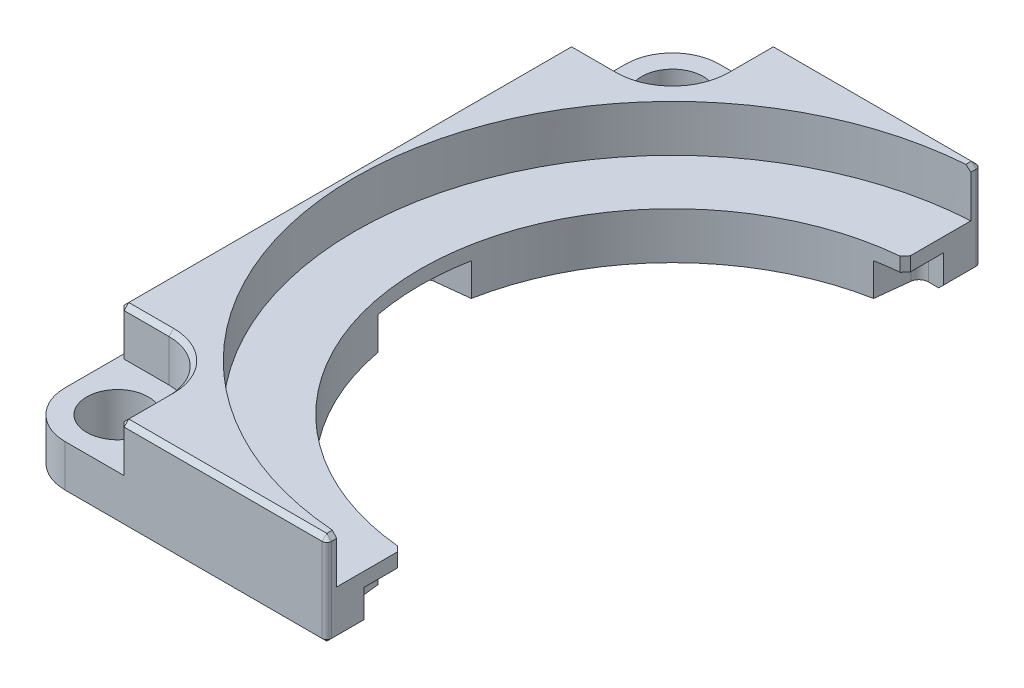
ISO-10303-21;
HEADER;
FILE_DESCRIPTION(('STEP AP214'),'2;1');
FILE_NAME('part.step','',(''),(''),'','','');
FILE_SCHEMA(('AUTOMOTIVE_DESIGN { 1 0 10303 214 1 1 1 1 }'));
ENDSEC;
DATA;
#1=APPLICATION_CONTEXT('core data for automotive mechanical design processes');
#2=APPLICATION_PROTOCOL_DEFINITION('international standard','automotive_design',2000,#1);
#3=PRODUCT_CONTEXT('',#1,'mechanical');
#4=PRODUCT('Part','Part','',(#3));
#5=PRODUCT_RELATED_PRODUCT_CATEGORY('part','',(#4));
#6=PRODUCT_DEFINITION_FORMATION('','',#4);
#7=PRODUCT_DEFINITION_CONTEXT('part definition',#1,'design');
#8=PRODUCT_DEFINITION('design','',#6,#7);
#9=PRODUCT_DEFINITION_SHAPE('','',#8);
#10=(LENGTH_UNIT() NAMED_UNIT(*) SI_UNIT(.MILLI.,.METRE.));
#11=(NAMED_UNIT(*) PLANE_ANGLE_UNIT() SI_UNIT($,.RADIAN.));
#12=(NAMED_UNIT(*) SI_UNIT($,.STERADIAN.) SOLID_ANGLE_UNIT());
#13=UNCERTAINTY_MEASURE_WITH_UNIT(LENGTH_MEASURE(1.E-05),#10,'distance_accuracy_value','');
#14=(GEOMETRIC_REPRESENTATION_CONTEXT(3) GLOBAL_UNCERTAINTY_ASSIGNED_CONTEXT((#13)) GLOBAL_UNIT_ASSIGNED_CONTEXT((#10,
#11,#12)) REPRESENTATION_CONTEXT('',''));
#15=CARTESIAN_POINT('',(0.,0.,0.));
#16=DIRECTION('',(0.,0.,1.));
#17=DIRECTION('',(1.,0.,0.));
#18=AXIS2_PLACEMENT_3D('',#15,#16,#17);
#19=CARTESIAN_POINT('',(-30.,10.,30.));
#20=DIRECTION('',(0.,-1.,0.));
#21=DIRECTION('',(0.,0.,-1.));
#22=AXIS2_PLACEMENT_3D('',#19,#20,#21);
#23=PLANE('',#22);
#24=CARTESIAN_POINT('',(0.,10.,0.));
#25=DIRECTION('',(0.,1.,0.));
#26=DIRECTION('',(0.,0.,1.));
#27=AXIS2_PLACEMENT_3D('',#24,#25,#26);
#28=CIRCLE('',#27,34.);
#29=CARTESIAN_POINT('',(-2.5,10.,-33.9079636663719));
#30=VERTEX_POINT('',#29);
#31=CARTESIAN_POINT('',(-2.5,10.,33.9079636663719));
#32=VERTEX_POINT('',#31);
#33=EDGE_CURVE('E369',#30,#32,#28,.T.);
#34=ORIENTED_EDGE('',*,*,#33,.F.);
#35=DIRECTION('',(0.,0.,-1.));
#36=VECTOR('',#35,1.);
#37=CARTESIAN_POINT('',(-2.5,10.,30.));
#38=LINE('',#37,#36);
#39=CARTESIAN_POINT('',(-2.5,10.,-34.5));
#40=VERTEX_POINT('',#39);
#41=EDGE_CURVE('E571',#30,#40,#38,.T.);
#42=ORIENTED_EDGE('',*,*,#41,.T.);
#43=DIRECTION('',(-1.,0.,0.));
#44=VECTOR('',#43,1.);
#45=CARTESIAN_POINT('',(-30.,10.,-34.5));
#46=LINE('',#45,#44);
#47=CARTESIAN_POINT('',(-23.7,10.,-34.5));
#48=VERTEX_POINT('',#47);
#49=EDGE_CURVE('E569',#40,#48,#46,.T.);
#50=ORIENTED_EDGE('',*,*,#49,.T.);
#51=DIRECTION('',(0.,0.,1.));
#52=VECTOR('',#51,1.);
#53=CARTESIAN_POINT('',(-23.7,10.,-29.7));
#54=LINE('',#53,#52);
#55=CARTESIAN_POINT('',(-23.7,10.,-29.7));
#56=VERTEX_POINT('',#55);
#57=EDGE_CURVE('E567',#48,#56,#54,.T.);
#58=ORIENTED_EDGE('',*,*,#57,.T.);
#59=CARTESIAN_POINT('',(-29.7,10.,-29.7));
#60=DIRECTION('',(0.,-1.,0.));
#61=DIRECTION('',(0.,0.,-1.));
#62=AXIS2_PLACEMENT_3D('',#59,#60,#61);
#63=CIRCLE('',#62,6.);
#64=CARTESIAN_POINT('',(-29.7,10.,-23.7));
#65=VERTEX_POINT('',#64);
#66=EDGE_CURVE('E565',#56,#65,#63,.T.);
#67=ORIENTED_EDGE('',*,*,#66,.T.);
#68=DIRECTION('',(-1.,0.,0.));
#69=VECTOR('',#68,1.);
#70=CARTESIAN_POINT('',(-35.,10.,-23.7));
#71=LINE('',#70,#69);
#72=CARTESIAN_POINT('',(-34.5,10.,-23.7));
#73=VERTEX_POINT('',#72);
#74=EDGE_CURVE('E563',#65,#73,#71,.T.);
#75=ORIENTED_EDGE('',*,*,#74,.T.);
#76=DIRECTION('',(0.,0.,1.));
#77=VECTOR('',#76,1.);
#78=CARTESIAN_POINT('',(-34.5,10.,30.));
#79=LINE('',#78,#77);
#80=CARTESIAN_POINT('',(-34.5,10.,23.7));
#81=VERTEX_POINT('',#80);
#82=EDGE_CURVE('E561',#73,#81,#79,.T.);
#83=ORIENTED_EDGE('',*,*,#82,.T.);
#84=DIRECTION('',(1.,0.,0.));
#85=VECTOR('',#84,1.);
#86=CARTESIAN_POINT('',(-29.7,10.,23.7));
#87=LINE('',#86,#85);
#88=CARTESIAN_POINT('',(-29.7,10.,23.7));
#89=VERTEX_POINT('',#88);
#90=EDGE_CURVE('E559',#81,#89,#87,.T.);
#91=ORIENTED_EDGE('',*,*,#90,.T.);
#92=CARTESIAN_POINT('',(-29.7,10.,29.7));
#93=DIRECTION('',(0.,-1.,0.));
#94=DIRECTION('',(0.,0.,-1.));
#95=AXIS2_PLACEMENT_3D('',#92,#93,#94);
#96=CIRCLE('',#95,6.);
#97=CARTESIAN_POINT('',(-23.7,10.,29.7));
#98=VERTEX_POINT('',#97);
#99=EDGE_CURVE('E557',#89,#98,#96,.T.);
#100=ORIENTED_EDGE('',*,*,#99,.T.);
#101=DIRECTION('',(0.,0.,1.));
#102=VECTOR('',#101,1.);
#103=CARTESIAN_POINT('',(-23.7,10.,35.));
#104=LINE('',#103,#102);
#105=CARTESIAN_POINT('',(-23.7,10.,34.5));
#106=VERTEX_POINT('',#105);
#107=EDGE_CURVE('E555',#98,#106,#104,.T.);
#108=ORIENTED_EDGE('',*,*,#107,.T.);
#109=DIRECTION('',(1.,0.,0.));
#110=VECTOR('',#109,1.);
#111=CARTESIAN_POINT('',(-30.,10.,34.5));
#112=LINE('',#111,#110);
#113=CARTESIAN_POINT('',(-2.5,10.,34.5));
#114=VERTEX_POINT('',#113);
#115=EDGE_CURVE('E551',#106,#114,#112,.T.);
#116=ORIENTED_EDGE('',*,*,#115,.T.);
#117=DIRECTION('',(0.,0.,-1.));
#118=VECTOR('',#117,1.);
#119=CARTESIAN_POINT('',(-2.5,10.,30.));
#120=LINE('',#119,#118);
#121=EDGE_CURVE('E553',#114,#32,#120,.T.);
#122=ORIENTED_EDGE('',*,*,#121,.T.);
#123=EDGE_LOOP('',(#34,#42,#50,#58,#67,#75,#83,#91,#100,#108,#116,#122));
#124=FACE_BOUND('',#123,.T.);
#125=ADVANCED_FACE('F17',(#124),#23,.F.);
#126=CARTESIAN_POINT('',(-2.,10.,35.));
#127=DIRECTION('',(-1.,0.,0.));
#128=DIRECTION('',(0.,0.,1.));
#129=AXIS2_PLACEMENT_3D('',#126,#127,#128);
#130=PLANE('',#129);
#131=DIRECTION('',(0.,0.,-1.));
#132=VECTOR('',#131,1.);
#133=CARTESIAN_POINT('',(-2.,3.5,35.));
#134=LINE('',#133,#132);
#135=CARTESIAN_POINT('',(-2.,3.5,31.));
#136=VERTEX_POINT('',#135);
#137=CARTESIAN_POINT('',(-2.,3.5,27.4258240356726));
#138=VERTEX_POINT('',#137);
#139=EDGE_CURVE('E513',#136,#138,#134,.T.);
#140=ORIENTED_EDGE('',*,*,#139,.T.);
#141=DIRECTION('',(0.,1.,0.));
#142=VECTOR('',#141,1.);
#143=CARTESIAN_POINT('',(-2.,10.,27.4258240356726));
#144=LINE('',#143,#142);
#145=CARTESIAN_POINT('',(-2.,5.,27.4258240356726));
#146=VERTEX_POINT('',#145);
#147=EDGE_CURVE('E632',#138,#146,#144,.T.);
#148=ORIENTED_EDGE('',*,*,#147,.T.);
#149=DIRECTION('',(0.,0.,-1.));
#150=VECTOR('',#149,1.);
#151=CARTESIAN_POINT('',(-2.,5.,26.9258240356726));
#152=LINE('',#151,#150);
#153=CARTESIAN_POINT('',(-2.,5.,33.9411254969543));
#154=VERTEX_POINT('',#153);
#155=EDGE_CURVE('E372',#154,#146,#152,.T.);
#156=ORIENTED_EDGE('',*,*,#155,.F.);
#157=DIRECTION('',(0.,-1.,0.));
#158=VECTOR('',#157,1.);
#159=CARTESIAN_POINT('',(-2.,10.,33.9411254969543));
#160=LINE('',#159,#158);
#161=CARTESIAN_POINT('',(-2.,9.5,33.9411254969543));
#162=VERTEX_POINT('',#161);
#163=EDGE_CURVE('E364',#162,#154,#160,.T.);
#164=ORIENTED_EDGE('',*,*,#163,.F.);
#165=DIRECTION('',(0.,0.,1.));
#166=VECTOR('',#165,1.);
#167=CARTESIAN_POINT('',(-2.,9.5,35.));
#168=LINE('',#167,#166);
#169=CARTESIAN_POINT('',(-2.,9.5,34.5));
#170=VERTEX_POINT('',#169);
#171=EDGE_CURVE('E630',#162,#170,#168,.T.);
#172=ORIENTED_EDGE('',*,*,#171,.T.);
#173=DIRECTION('',(0.,-1.,0.));
#174=VECTOR('',#173,1.);
#175=CARTESIAN_POINT('',(-2.,10.,34.5));
#176=LINE('',#175,#174);
#177=CARTESIAN_POINT('',(-2.,0.5,34.5));
#178=VERTEX_POINT('',#177);
#179=EDGE_CURVE('E537',#170,#178,#176,.T.);
#180=ORIENTED_EDGE('',*,*,#179,.T.);
#181=DIRECTION('',(0.,0.,-1.));
#182=VECTOR('',#181,1.);
#183=CARTESIAN_POINT('',(-2.,0.5,31.));
#184=LINE('',#183,#182);
#185=CARTESIAN_POINT('',(-2.,0.5,31.));
#186=VERTEX_POINT('',#185);
#187=EDGE_CURVE('E627',#178,#186,#184,.T.);
#188=ORIENTED_EDGE('',*,*,#187,.T.);
#189=DIRECTION('',(0.,-1.,0.));
#190=VECTOR('',#189,1.);
#191=CARTESIAN_POINT('',(-2.,10.,31.));
#192=LINE('',#191,#190);
#193=EDGE_CURVE('E463',#136,#186,#192,.T.);
#194=ORIENTED_EDGE('',*,*,#193,.F.);
#195=EDGE_LOOP('',(#140,#148,#156,#164,#172,#180,#188,#194));
#196=FACE_BOUND('',#195,.T.);
#197=ADVANCED_FACE('F836',(#196),#130,.F.);
#198=CARTESIAN_POINT('',(0.,10.,0.));
#199=DIRECTION('',(0.,-1.,0.));
#200=DIRECTION('',(0.,0.,-1.));
#201=AXIS2_PLACEMENT_3D('',#198,#199,#200);
#202=CYLINDRICAL_SURFACE('',#201,27.);
#203=CARTESIAN_POINT('',(0.,5.,0.));
#204=DIRECTION('',(0.,-1.,0.));
#205=DIRECTION('',(0.,0.,1.));
#206=AXIS2_PLACEMENT_3D('',#203,#204,#205);
#207=CIRCLE('',#206,27.);
#208=CARTESIAN_POINT('',(-2.54614498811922,5.,26.8796790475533));
#209=VERTEX_POINT('',#208);
#210=CARTESIAN_POINT('',(-2.50298176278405,5.,-26.8837326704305));
#211=VERTEX_POINT('',#210);
#212=EDGE_CURVE('E349',#209,#211,#207,.T.);
#213=ORIENTED_EDGE('',*,*,#212,.F.);
#214=DIRECTION('',(0.,-1.,0.));
#215=VECTOR('',#214,1.);
#216=CARTESIAN_POINT('',(-2.54614498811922,10.,26.8796790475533));
#217=LINE('',#216,#215);
#218=CARTESIAN_POINT('',(-2.54614498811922,3.5,26.8796790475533));
#219=VERTEX_POINT('',#218);
#220=EDGE_CURVE('E622',#209,#219,#217,.T.);
#221=ORIENTED_EDGE('',*,*,#220,.T.);
#222=CARTESIAN_POINT('',(0.,3.5,0.));
#223=DIRECTION('',(0.,-1.,0.));
#224=DIRECTION('',(0.,0.,1.));
#225=AXIS2_PLACEMENT_3D('',#222,#223,#224);
#226=CIRCLE('',#225,27.);
#227=CARTESIAN_POINT('',(-5.00000000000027,3.5,26.5329983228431));
#228=VERTEX_POINT('',#227);
#229=EDGE_CURVE('E486',#219,#228,#226,.T.);
#230=ORIENTED_EDGE('',*,*,#229,.T.);
#231=DIRECTION('',(0.,-1.,0.));
#232=VECTOR('',#231,1.);
#233=CARTESIAN_POINT('',(-5.00000000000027,3.5,26.5329983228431));
#234=LINE('',#233,#232);
#235=CARTESIAN_POINT('',(-5.00000000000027,0.,26.5329983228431));
#236=VERTEX_POINT('',#235);
#237=EDGE_CURVE('E478',#228,#236,#234,.T.);
#238=ORIENTED_EDGE('',*,*,#237,.T.);
#239=CARTESIAN_POINT('',(0.,0.,0.));
#240=DIRECTION('',(0.,-1.,0.));
#241=DIRECTION('',(0.,0.,1.));
#242=AXIS2_PLACEMENT_3D('',#239,#240,#241);
#243=CIRCLE('',#242,27.);
#244=CARTESIAN_POINT('',(-26.5329983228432,0.,5.));
#245=VERTEX_POINT('',#244);
#246=EDGE_CURVE('E519',#236,#245,#243,.T.);
#247=ORIENTED_EDGE('',*,*,#246,.T.);
#248=DIRECTION('',(0.,-1.,0.));
#249=VECTOR('',#248,1.);
#250=CARTESIAN_POINT('',(-26.5329983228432,3.5,5.));
#251=LINE('',#250,#249);
#252=CARTESIAN_POINT('',(-26.5329983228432,3.5,5.));
#253=VERTEX_POINT('',#252);
#254=EDGE_CURVE('E435',#253,#245,#251,.T.);
#255=ORIENTED_EDGE('',*,*,#254,.F.);
#256=CARTESIAN_POINT('',(0.,3.5,0.));
#257=DIRECTION('',(0.,-1.,0.));
#258=DIRECTION('',(0.,0.,1.));
#259=AXIS2_PLACEMENT_3D('',#256,#257,#258);
#260=CIRCLE('',#259,27.);
#261=CARTESIAN_POINT('',(-26.5329983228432,3.5,-5.));
#262=VERTEX_POINT('',#261);
#263=EDGE_CURVE('E421',#253,#262,#260,.T.);
#264=ORIENTED_EDGE('',*,*,#263,.T.);
#265=DIRECTION('',(0.,-1.,0.));
#266=VECTOR('',#265,1.);
#267=CARTESIAN_POINT('',(-26.5329983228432,3.5,-5.));
#268=LINE('',#267,#266);
#269=CARTESIAN_POINT('',(-26.5329983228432,0.,-5.));
#270=VERTEX_POINT('',#269);
#271=EDGE_CURVE('E460',#262,#270,#268,.T.);
#272=ORIENTED_EDGE('',*,*,#271,.T.);
#273=CARTESIAN_POINT('',(-4.99999999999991,0.,-26.5329983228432));
#274=VERTEX_POINT('',#273);
#275=EDGE_CURVE('E516',#270,#274,#243,.T.);
#276=ORIENTED_EDGE('',*,*,#275,.T.);
#277=DIRECTION('',(0.,-1.,0.));
#278=VECTOR('',#277,1.);
#279=CARTESIAN_POINT('',(-4.99999999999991,3.5,-26.5329983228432));
#280=LINE('',#279,#278);
#281=CARTESIAN_POINT('',(-4.99999999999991,3.5,-26.5329983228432));
#282=VERTEX_POINT('',#281);
#283=EDGE_CURVE('E474',#282,#274,#280,.T.);
#284=ORIENTED_EDGE('',*,*,#283,.F.);
#285=CARTESIAN_POINT('',(0.,3.5,0.));
#286=DIRECTION('',(0.,-1.,0.));
#287=DIRECTION('',(0.,0.,1.));
#288=AXIS2_PLACEMENT_3D('',#285,#286,#287);
#289=CIRCLE('',#288,27.);
#290=CARTESIAN_POINT('',(-2.50298176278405,3.5,-26.8837326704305));
#291=VERTEX_POINT('',#290);
#292=EDGE_CURVE('E464',#282,#291,#289,.T.);
#293=ORIENTED_EDGE('',*,*,#292,.T.);
#294=DIRECTION('',(0.,-1.,0.));
#295=VECTOR('',#294,1.);
#296=CARTESIAN_POINT('',(-2.50298176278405,10.,-26.8837326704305));
#297=LINE('',#296,#295);
#298=EDGE_CURVE('E620',#291,#211,#297,.F.);
#299=ORIENTED_EDGE('',*,*,#298,.T.);
#300=EDGE_LOOP('',(#213,#221,#230,#238,#247,#255,#264,#272,#276,#284,#293,#299));
#301=FACE_BOUND('',#300,.T.);
#302=ADVANCED_FACE('F789',(#301),#202,.F.);
#303=CARTESIAN_POINT('',(-2.,10.,-35.));
#304=DIRECTION('',(-1.,0.,0.));
#305=DIRECTION('',(0.,0.,1.));
#306=AXIS2_PLACEMENT_3D('',#303,#304,#305);
#307=PLANE('',#306);
#308=DIRECTION('',(0.,-1.,0.));
#309=VECTOR('',#308,1.);
#310=CARTESIAN_POINT('',(-2.,10.,-34.5));
#311=LINE('',#310,#309);
#312=CARTESIAN_POINT('',(-2.,0.5,-34.5));
#313=VERTEX_POINT('',#312);
#314=CARTESIAN_POINT('',(-2.,9.5,-34.5));
#315=VERTEX_POINT('',#314);
#316=EDGE_CURVE('E549',#313,#315,#311,.F.);
#317=ORIENTED_EDGE('',*,*,#316,.T.);
#318=DIRECTION('',(0.,0.,1.));
#319=VECTOR('',#318,1.);
#320=CARTESIAN_POINT('',(-2.,9.5,-35.));
#321=LINE('',#320,#319);
#322=CARTESIAN_POINT('',(-2.,9.5,-33.9411254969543));
#323=VERTEX_POINT('',#322);
#324=EDGE_CURVE('E356',#315,#323,#321,.T.);
#325=ORIENTED_EDGE('',*,*,#324,.T.);
#326=DIRECTION('',(0.,-1.,0.));
#327=VECTOR('',#326,1.);
#328=CARTESIAN_POINT('',(-2.,10.,-33.9411254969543));
#329=LINE('',#328,#327);
#330=CARTESIAN_POINT('',(-2.,5.,-33.9411254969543));
#331=VERTEX_POINT('',#330);
#332=EDGE_CURVE('E352',#323,#331,#329,.T.);
#333=ORIENTED_EDGE('',*,*,#332,.T.);
#334=DIRECTION('',(0.,0.,-1.));
#335=VECTOR('',#334,1.);
#336=CARTESIAN_POINT('',(-2.,5.,-26.9258240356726));
#337=LINE('',#336,#335);
#338=CARTESIAN_POINT('',(-2.,5.,-27.4674310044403));
#339=VERTEX_POINT('',#338);
#340=EDGE_CURVE('E336',#339,#331,#337,.T.);
#341=ORIENTED_EDGE('',*,*,#340,.F.);
#342=DIRECTION('',(0.,-1.,0.));
#343=VECTOR('',#342,1.);
#344=CARTESIAN_POINT('',(-2.,10.,-27.4674310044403));
#345=LINE('',#344,#343);
#346=CARTESIAN_POINT('',(-2.,3.5,-27.4674310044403));
#347=VERTEX_POINT('',#346);
#348=EDGE_CURVE('E576',#339,#347,#345,.T.);
#349=ORIENTED_EDGE('',*,*,#348,.T.);
#350=DIRECTION('',(0.,0.,-1.));
#351=VECTOR('',#350,1.);
#352=CARTESIAN_POINT('',(-2.,3.5,-35.));
#353=LINE('',#352,#351);
#354=CARTESIAN_POINT('',(-2.,3.5,-31.));
#355=VERTEX_POINT('',#354);
#356=EDGE_CURVE('E534',#347,#355,#353,.T.);
#357=ORIENTED_EDGE('',*,*,#356,.T.);
#358=DIRECTION('',(0.,1.,0.));
#359=VECTOR('',#358,1.);
#360=CARTESIAN_POINT('',(-2.,10.,-31.));
#361=LINE('',#360,#359);
#362=CARTESIAN_POINT('',(-2.,0.5,-31.));
#363=VERTEX_POINT('',#362);
#364=EDGE_CURVE('E511',#363,#355,#361,.T.);
#365=ORIENTED_EDGE('',*,*,#364,.F.);
#366=DIRECTION('',(0.,0.,-1.));
#367=VECTOR('',#366,1.);
#368=CARTESIAN_POINT('',(-2.,0.5,-34.5));
#369=LINE('',#368,#367);
#370=EDGE_CURVE('E574',#363,#313,#369,.T.);
#371=ORIENTED_EDGE('',*,*,#370,.T.);
#372=EDGE_LOOP('',(#317,#325,#333,#341,#349,#357,#365,#371));
#373=FACE_BOUND('',#372,.T.);
#374=ADVANCED_FACE('F354',(#373),#307,.F.);
#375=CARTESIAN_POINT('',(-2.,10.,35.));
#376=DIRECTION('',(0.,0.,-1.));
#377=DIRECTION('',(-1.,0.,0.));
#378=AXIS2_PLACEMENT_3D('',#375,#376,#377);
#379=PLANE('',#378);
#380=DIRECTION('',(0.,-1.,0.));
#381=VECTOR('',#380,1.);
#382=CARTESIAN_POINT('',(-30.,10.,35.));
#383=LINE('',#382,#381);
#384=CARTESIAN_POINT('',(-30.,5.,35.));
#385=VERTEX_POINT('',#384);
#386=CARTESIAN_POINT('',(-30.,0.5,35.));
#387=VERTEX_POINT('',#386);
#388=EDGE_CURVE('E520',#385,#387,#383,.T.);
#389=ORIENTED_EDGE('',*,*,#388,.T.);
#390=DIRECTION('',(1.,0.,0.));
#391=VECTOR('',#390,1.);
#392=CARTESIAN_POINT('',(-2.5,0.5,35.));
#393=LINE('',#392,#391);
#394=CARTESIAN_POINT('',(-2.5,0.5,35.));
#395=VERTEX_POINT('',#394);
#396=EDGE_CURVE('E671',#387,#395,#393,.T.);
#397=ORIENTED_EDGE('',*,*,#396,.T.);
#398=DIRECTION('',(0.,-1.,0.));
#399=VECTOR('',#398,1.);
#400=CARTESIAN_POINT('',(-2.5,10.,35.));
#401=LINE('',#400,#399);
#402=CARTESIAN_POINT('',(-2.5,9.5,35.));
#403=VERTEX_POINT('',#402);
#404=EDGE_CURVE('E544',#395,#403,#401,.F.);
#405=ORIENTED_EDGE('',*,*,#404,.T.);
#406=DIRECTION('',(-1.,0.,0.));
#407=VECTOR('',#406,1.);
#408=CARTESIAN_POINT('',(-2.,9.5,35.));
#409=LINE('',#408,#407);
#410=CARTESIAN_POINT('',(-23.7,9.5,35.));
#411=VERTEX_POINT('',#410);
#412=EDGE_CURVE('E41',#403,#411,#409,.T.);
#413=ORIENTED_EDGE('',*,*,#412,.T.);
#414=DIRECTION('',(0.,-1.,0.));
#415=VECTOR('',#414,1.);
#416=CARTESIAN_POINT('',(-23.7,5.,35.));
#417=LINE('',#416,#415);
#418=CARTESIAN_POINT('',(-23.7,5.,35.));
#419=VERTEX_POINT('',#418);
#420=EDGE_CURVE('E669',#411,#419,#417,.T.);
#421=ORIENTED_EDGE('',*,*,#420,.T.);
#422=DIRECTION('',(1.,0.,0.));
#423=VECTOR('',#422,1.);
#424=CARTESIAN_POINT('',(-24.2,5.,35.));
#425=LINE('',#424,#423);
#426=EDGE_CURVE('E34',#385,#419,#425,.T.);
#427=ORIENTED_EDGE('',*,*,#426,.F.);
#428=EDGE_LOOP('',(#389,#397,#405,#413,#421,#427));
#429=FACE_BOUND('',#428,.T.);
#430=ADVANCED_FACE('F948',(#429),#379,.F.);
#431=CARTESIAN_POINT('',(-2.,10.,-35.));
#432=DIRECTION('',(0.,0.,1.));
#433=DIRECTION('',(1.,0.,0.));
#434=AXIS2_PLACEMENT_3D('',#431,#432,#433);
#435=PLANE('',#434);
#436=DIRECTION('',(-1.,0.,0.));
#437=VECTOR('',#436,1.);
#438=CARTESIAN_POINT('',(-24.2,5.,-35.));
#439=LINE('',#438,#437);
#440=CARTESIAN_POINT('',(-23.7,5.,-35.));
#441=VERTEX_POINT('',#440);
#442=CARTESIAN_POINT('',(-30.,5.,-35.));
#443=VERTEX_POINT('',#442);
#444=EDGE_CURVE('E390',#441,#443,#439,.T.);
#445=ORIENTED_EDGE('',*,*,#444,.F.);
#446=DIRECTION('',(0.,1.,0.));
#447=VECTOR('',#446,1.);
#448=CARTESIAN_POINT('',(-23.7,10.,-35.));
#449=LINE('',#448,#447);
#450=CARTESIAN_POINT('',(-23.7,9.5,-35.));
#451=VERTEX_POINT('',#450);
#452=EDGE_CURVE('E599',#441,#451,#449,.T.);
#453=ORIENTED_EDGE('',*,*,#452,.T.);
#454=DIRECTION('',(1.,0.,0.));
#455=VECTOR('',#454,1.);
#456=CARTESIAN_POINT('',(-2.,9.5,-35.));
#457=LINE('',#456,#455);
#458=CARTESIAN_POINT('',(-2.5,9.5,-35.));
#459=VERTEX_POINT('',#458);
#460=EDGE_CURVE('E597',#451,#459,#457,.T.);
#461=ORIENTED_EDGE('',*,*,#460,.T.);
#462=DIRECTION('',(0.,-1.,0.));
#463=VECTOR('',#462,1.);
#464=CARTESIAN_POINT('',(-2.5,10.,-35.));
#465=LINE('',#464,#463);
#466=CARTESIAN_POINT('',(-2.5,0.5,-35.));
#467=VERTEX_POINT('',#466);
#468=EDGE_CURVE('E546',#459,#467,#465,.T.);
#469=ORIENTED_EDGE('',*,*,#468,.T.);
#470=DIRECTION('',(-1.,0.,0.));
#471=VECTOR('',#470,1.);
#472=CARTESIAN_POINT('',(-30.,0.5,-35.));
#473=LINE('',#472,#471);
#474=CARTESIAN_POINT('',(-30.,0.5,-35.));
#475=VERTEX_POINT('',#474);
#476=EDGE_CURVE('E595',#467,#475,#473,.T.);
#477=ORIENTED_EDGE('',*,*,#476,.T.);
#478=DIRECTION('',(0.,-1.,0.));
#479=VECTOR('',#478,1.);
#480=CARTESIAN_POINT('',(-30.,10.,-35.));
#481=LINE('',#480,#479);
#482=EDGE_CURVE('E529',#443,#475,#481,.T.);
#483=ORIENTED_EDGE('',*,*,#482,.F.);
#484=EDGE_LOOP('',(#445,#453,#461,#469,#477,#483));
#485=FACE_BOUND('',#484,.T.);
#486=ADVANCED_FACE('F869',(#485),#435,.F.);
#487=CARTESIAN_POINT('',(-30.,10.,-30.));
#488=DIRECTION('',(0.,-1.,0.));
#489=DIRECTION('',(0.,0.,-1.));
#490=AXIS2_PLACEMENT_3D('',#487,#488,#489);
#491=CYLINDRICAL_SURFACE('',#490,5.);
#492=ORIENTED_EDGE('',*,*,#482,.T.);
#493=CARTESIAN_POINT('',(-30.,0.5,-30.));
#494=DIRECTION('',(0.,-1.,0.));
#495=DIRECTION('',(0.,0.,-1.));
#496=AXIS2_PLACEMENT_3D('',#493,#494,#495);
#497=CIRCLE('',#496,5.);
#498=CARTESIAN_POINT('',(-35.,0.5,-30.));
#499=VERTEX_POINT('',#498);
#500=EDGE_CURVE('E660',#475,#499,#497,.F.);
#501=ORIENTED_EDGE('',*,*,#500,.T.);
#502=DIRECTION('',(0.,-1.,0.));
#503=VECTOR('',#502,1.);
#504=CARTESIAN_POINT('',(-35.,10.,-30.));
#505=LINE('',#504,#503);
#506=CARTESIAN_POINT('',(-35.,5.,-30.));
#507=VERTEX_POINT('',#506);
#508=EDGE_CURVE('E526',#507,#499,#505,.T.);
#509=ORIENTED_EDGE('',*,*,#508,.F.);
#510=CARTESIAN_POINT('',(-30.,5.,-30.));
#511=DIRECTION('',(0.,1.,0.));
#512=DIRECTION('',(0.,0.,1.));
#513=AXIS2_PLACEMENT_3D('',#510,#511,#512);
#514=CIRCLE('',#513,5.);
#515=EDGE_CURVE('E376',#443,#507,#514,.T.);
#516=ORIENTED_EDGE('',*,*,#515,.F.);
#517=EDGE_LOOP('',(#492,#501,#509,#516));
#518=FACE_BOUND('',#517,.T.);
#519=ADVANCED_FACE('F873',(#518),#491,.T.);
#520=CARTESIAN_POINT('',(-35.,10.,-30.));
#521=DIRECTION('',(1.,0.,0.));
#522=DIRECTION('',(0.,0.,-1.));
#523=AXIS2_PLACEMENT_3D('',#520,#521,#522);
#524=PLANE('',#523);
#525=DIRECTION('',(0.,-1.,0.));
#526=VECTOR('',#525,1.);
#527=CARTESIAN_POINT('',(-35.,5.,-23.7));
#528=LINE('',#527,#526);
#529=CARTESIAN_POINT('',(-35.,9.5,-23.7));
#530=VERTEX_POINT('',#529);
#531=CARTESIAN_POINT('',(-35.,5.,-23.7));
#532=VERTEX_POINT('',#531);
#533=EDGE_CURVE('E613',#530,#532,#528,.T.);
#534=ORIENTED_EDGE('',*,*,#533,.T.);
#535=DIRECTION('',(0.,0.,1.));
#536=VECTOR('',#535,1.);
#537=CARTESIAN_POINT('',(-35.,5.,-30.));
#538=LINE('',#537,#536);
#539=EDGE_CURVE('E378',#507,#532,#538,.T.);
#540=ORIENTED_EDGE('',*,*,#539,.F.);
#541=ORIENTED_EDGE('',*,*,#508,.T.);
#542=DIRECTION('',(0.,0.,1.));
#543=VECTOR('',#542,1.);
#544=CARTESIAN_POINT('',(-35.,0.5,30.));
#545=LINE('',#544,#543);
#546=CARTESIAN_POINT('',(-35.,0.5,30.));
#547=VERTEX_POINT('',#546);
#548=EDGE_CURVE('E607',#499,#547,#545,.T.);
#549=ORIENTED_EDGE('',*,*,#548,.T.);
#550=DIRECTION('',(0.,-1.,0.));
#551=VECTOR('',#550,1.);
#552=CARTESIAN_POINT('',(-35.,10.,30.));
#553=LINE('',#552,#551);
#554=CARTESIAN_POINT('',(-35.,5.,30.));
#555=VERTEX_POINT('',#554);
#556=EDGE_CURVE('E523',#555,#547,#553,.T.);
#557=ORIENTED_EDGE('',*,*,#556,.F.);
#558=DIRECTION('',(0.,0.,1.));
#559=VECTOR('',#558,1.);
#560=CARTESIAN_POINT('',(-35.,5.,30.));
#561=LINE('',#560,#559);
#562=CARTESIAN_POINT('',(-35.,5.,23.7));
#563=VERTEX_POINT('',#562);
#564=EDGE_CURVE('E402',#563,#555,#561,.T.);
#565=ORIENTED_EDGE('',*,*,#564,.F.);
#566=DIRECTION('',(0.,1.,0.));
#567=VECTOR('',#566,1.);
#568=CARTESIAN_POINT('',(-35.,10.,23.7));
#569=LINE('',#568,#567);
#570=CARTESIAN_POINT('',(-35.,9.5,23.7));
#571=VERTEX_POINT('',#570);
#572=EDGE_CURVE('E611',#563,#571,#569,.T.);
#573=ORIENTED_EDGE('',*,*,#572,.T.);
#574=DIRECTION('',(0.,0.,-1.));
#575=VECTOR('',#574,1.);
#576=CARTESIAN_POINT('',(-35.,9.5,-30.));
#577=LINE('',#576,#575);
#578=EDGE_CURVE('E609',#571,#530,#577,.T.);
#579=ORIENTED_EDGE('',*,*,#578,.T.);
#580=EDGE_LOOP('',(#534,#540,#541,#549,#557,#565,#573,#579));
#581=FACE_BOUND('',#580,.T.);
#582=ADVANCED_FACE('F880',(#581),#524,.F.);
#583=CARTESIAN_POINT('',(-29.7,10.,-29.7));
#584=DIRECTION('',(0.,1.,0.));
#585=DIRECTION('',(0.,0.,1.));
#586=AXIS2_PLACEMENT_3D('',#583,#584,#585);
#587=CYLINDRICAL_SURFACE('',#586,3.3);
#588=CARTESIAN_POINT('',(-29.7,0.,-29.7));
#589=DIRECTION('',(0.,1.,0.));
#590=DIRECTION('',(0.,0.,1.));
#591=AXIS2_PLACEMENT_3D('',#588,#589,#590);
#592=CIRCLE('',#591,3.3);
#593=CARTESIAN_POINT('',(-29.7,0.,-26.4));
#594=VERTEX_POINT('',#593);
#595=EDGE_CURVE('E413',#594,#594,#592,.T.);
#596=ORIENTED_EDGE('',*,*,#595,.F.);
#597=EDGE_LOOP('',(#596));
#598=FACE_BOUND('',#597,.T.);
#599=CARTESIAN_POINT('',(-29.7,5.,-29.7));
#600=DIRECTION('',(0.,1.,0.));
#601=DIRECTION('',(0.,0.,1.));
#602=AXIS2_PLACEMENT_3D('',#599,#600,#601);
#603=CIRCLE('',#602,3.3);
#604=CARTESIAN_POINT('',(-29.7,5.,-26.4));
#605=VERTEX_POINT('',#604);
#606=EDGE_CURVE('E396',#605,#605,#603,.F.);
#607=ORIENTED_EDGE('',*,*,#606,.F.);
#608=EDGE_LOOP('',(#607));
#609=FACE_BOUND('',#608,.T.);
#610=ADVANCED_FACE('F996',(#598,#609),#587,.F.);
#611=CARTESIAN_POINT('',(-30.,0.,30.));
#612=DIRECTION('',(0.,-1.,0.));
#613=DIRECTION('',(0.,0.,-1.));
#614=AXIS2_PLACEMENT_3D('',#611,#612,#613);
#615=PLANE('',#614);
#616=DIRECTION('',(1.,0.,0.));
#617=VECTOR('',#616,1.);
#618=CARTESIAN_POINT('',(-3.60568702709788,0.,31.));
#619=LINE('',#618,#617);
#620=CARTESIAN_POINT('',(-3.60568702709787,0.,31.));
#621=VERTEX_POINT('',#620);
#622=CARTESIAN_POINT('',(-2.5,0.,31.));
#623=VERTEX_POINT('',#622);
#624=EDGE_CURVE('E489',#621,#623,#619,.T.);
#625=ORIENTED_EDGE('',*,*,#624,.T.);
#626=DIRECTION('',(0.,0.,1.));
#627=VECTOR('',#626,1.);
#628=CARTESIAN_POINT('',(-2.5,0.,34.5));
#629=LINE('',#628,#627);
#630=CARTESIAN_POINT('',(-2.5,0.,34.5));
#631=VERTEX_POINT('',#630);
#632=EDGE_CURVE('E656',#623,#631,#629,.T.);
#633=ORIENTED_EDGE('',*,*,#632,.T.);
#634=DIRECTION('',(-1.,0.,0.));
#635=VECTOR('',#634,1.);
#636=CARTESIAN_POINT('',(-30.,0.,34.5));
#637=LINE('',#636,#635);
#638=CARTESIAN_POINT('',(-30.,0.,34.5));
#639=VERTEX_POINT('',#638);
#640=EDGE_CURVE('E644',#631,#639,#637,.T.);
#641=ORIENTED_EDGE('',*,*,#640,.T.);
#642=CARTESIAN_POINT('',(-30.,0.,30.));
#643=DIRECTION('',(0.,-1.,0.));
#644=DIRECTION('',(0.,0.,-1.));
#645=AXIS2_PLACEMENT_3D('',#642,#643,#644);
#646=CIRCLE('',#645,4.5);
#647=CARTESIAN_POINT('',(-34.5,0.,30.));
#648=VERTEX_POINT('',#647);
#649=EDGE_CURVE('E646',#639,#648,#646,.T.);
#650=ORIENTED_EDGE('',*,*,#649,.T.);
#651=DIRECTION('',(0.,0.,-1.));
#652=VECTOR('',#651,1.);
#653=CARTESIAN_POINT('',(-34.5,0.,-30.));
#654=LINE('',#653,#652);
#655=CARTESIAN_POINT('',(-34.5,0.,-30.));
#656=VERTEX_POINT('',#655);
#657=EDGE_CURVE('E648',#648,#656,#654,.T.);
#658=ORIENTED_EDGE('',*,*,#657,.T.);
#659=CARTESIAN_POINT('',(-30.,0.,-30.));
#660=DIRECTION('',(0.,-1.,0.));
#661=DIRECTION('',(0.,0.,-1.));
#662=AXIS2_PLACEMENT_3D('',#659,#660,#661);
#663=CIRCLE('',#662,4.5);
#664=CARTESIAN_POINT('',(-30.,0.,-34.5));
#665=VERTEX_POINT('',#664);
#666=EDGE_CURVE('E650',#656,#665,#663,.T.);
#667=ORIENTED_EDGE('',*,*,#666,.T.);
#668=DIRECTION('',(1.,0.,0.));
#669=VECTOR('',#668,1.);
#670=CARTESIAN_POINT('',(-2.5,0.,-34.5));
#671=LINE('',#670,#669);
#672=CARTESIAN_POINT('',(-2.5,0.,-34.5));
#673=VERTEX_POINT('',#672);
#674=EDGE_CURVE('E652',#665,#673,#671,.T.);
#675=ORIENTED_EDGE('',*,*,#674,.T.);
#676=DIRECTION('',(0.,0.,1.));
#677=VECTOR('',#676,1.);
#678=CARTESIAN_POINT('',(-2.5,0.,-31.));
#679=LINE('',#678,#677);
#680=CARTESIAN_POINT('',(-2.5,0.,-31.));
#681=VERTEX_POINT('',#680);
#682=EDGE_CURVE('E654',#673,#681,#679,.T.);
#683=ORIENTED_EDGE('',*,*,#682,.T.);
#684=DIRECTION('',(-1.,0.,0.));
#685=VECTOR('',#684,1.);
#686=CARTESIAN_POINT('',(-30.,0.,-31.));
#687=LINE('',#686,#685);
#688=CARTESIAN_POINT('',(-3.60568702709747,0.,-31.));
#689=VERTEX_POINT('',#688);
#690=EDGE_CURVE('E532',#681,#689,#687,.T.);
#691=ORIENTED_EDGE('',*,*,#690,.T.);
#692=CARTESIAN_POINT('',(-3.60568702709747,0.,-30.));
#693=DIRECTION('',(0.,1.,0.));
#694=DIRECTION('',(0.,0.,-1.));
#695=AXIS2_PLACEMENT_3D('',#692,#693,#694);
#696=CIRCLE('',#695,1.);
#697=CARTESIAN_POINT('',(-4.5994809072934,0.,-30.1112372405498));
#698=VERTEX_POINT('',#697);
#699=EDGE_CURVE('E475',#689,#698,#696,.T.);
#700=ORIENTED_EDGE('',*,*,#699,.T.);
#701=DIRECTION('',(-0.111237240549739,0.,0.993793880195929));
#702=VECTOR('',#701,1.);
#703=CARTESIAN_POINT('',(-4.99999999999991,0.,-26.5329983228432));
#704=LINE('',#703,#702);
#705=EDGE_CURVE('E468',#698,#274,#704,.T.);
#706=ORIENTED_EDGE('',*,*,#705,.T.);
#707=ORIENTED_EDGE('',*,*,#275,.F.);
#708=DIRECTION('',(-0.993793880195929,0.,0.111237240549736));
#709=VECTOR('',#708,1.);
#710=CARTESIAN_POINT('',(-26.5329983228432,0.,-5.));
#711=LINE('',#710,#709);
#712=CARTESIAN_POINT('',(-30.1112372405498,0.,-4.59948090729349));
#713=VERTEX_POINT('',#712);
#714=EDGE_CURVE('E436',#270,#713,#711,.T.);
#715=ORIENTED_EDGE('',*,*,#714,.T.);
#716=CARTESIAN_POINT('',(-30.,0.,-3.60568702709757));
#717=DIRECTION('',(0.,1.,0.));
#718=DIRECTION('',(0.,0.,1.));
#719=AXIS2_PLACEMENT_3D('',#716,#717,#718);
#720=CIRCLE('',#719,1.);
#721=CARTESIAN_POINT('',(-31.,0.,-3.60568702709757));
#722=VERTEX_POINT('',#721);
#723=EDGE_CURVE('E439',#713,#722,#720,.T.);
#724=ORIENTED_EDGE('',*,*,#723,.T.);
#725=DIRECTION('',(0.,0.,1.));
#726=VECTOR('',#725,1.);
#727=CARTESIAN_POINT('',(-31.,0.,-3.60568702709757));
#728=LINE('',#727,#726);
#729=CARTESIAN_POINT('',(-31.,0.,3.60568702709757));
#730=VERTEX_POINT('',#729);
#731=EDGE_CURVE('E443',#722,#730,#728,.T.);
#732=ORIENTED_EDGE('',*,*,#731,.T.);
#733=CARTESIAN_POINT('',(-30.,0.,3.60568702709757));
#734=DIRECTION('',(0.,1.,0.));
#735=DIRECTION('',(0.,0.,-1.));
#736=AXIS2_PLACEMENT_3D('',#733,#734,#735);
#737=CIRCLE('',#736,1.);
#738=CARTESIAN_POINT('',(-30.1112372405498,0.,4.5994809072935));
#739=VERTEX_POINT('',#738);
#740=EDGE_CURVE('E446',#730,#739,#737,.T.);
#741=ORIENTED_EDGE('',*,*,#740,.T.);
#742=DIRECTION('',(0.993793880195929,0.,0.111237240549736));
#743=VECTOR('',#742,1.);
#744=CARTESIAN_POINT('',(-26.5329983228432,0.,5.));
#745=LINE('',#744,#743);
#746=EDGE_CURVE('E425',#739,#245,#745,.T.);
#747=ORIENTED_EDGE('',*,*,#746,.T.);
#748=ORIENTED_EDGE('',*,*,#246,.F.);
#749=DIRECTION('',(0.111237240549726,0.,0.99379388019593));
#750=VECTOR('',#749,1.);
#751=CARTESIAN_POINT('',(-5.00000000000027,0.,26.5329983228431));
#752=LINE('',#751,#750);
#753=CARTESIAN_POINT('',(-4.5994809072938,0.,30.1112372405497));
#754=VERTEX_POINT('',#753);
#755=EDGE_CURVE('E420',#236,#754,#752,.T.);
#756=ORIENTED_EDGE('',*,*,#755,.T.);
#757=CARTESIAN_POINT('',(-3.60568702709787,0.,30.));
#758=DIRECTION('',(0.,1.,0.));
#759=DIRECTION('',(0.,0.,1.));
#760=AXIS2_PLACEMENT_3D('',#757,#758,#759);
#761=CIRCLE('',#760,1.);
#762=EDGE_CURVE('E499',#754,#621,#761,.T.);
#763=ORIENTED_EDGE('',*,*,#762,.T.);
#764=EDGE_LOOP('',(#625,#633,#641,#650,#658,#667,#675,#683,#691,#700,#706,#707,#715,#724,#732,
#741,#747,#748,#756,#763));
#765=FACE_BOUND('',#764,.T.);
#766=ORIENTED_EDGE('',*,*,#595,.T.);
#767=EDGE_LOOP('',(#766));
#768=FACE_BOUND('',#767,.T.);
#769=CARTESIAN_POINT('',(-29.7,0.,29.7));
#770=DIRECTION('',(0.,1.,0.));
#771=DIRECTION('',(0.,0.,1.));
#772=AXIS2_PLACEMENT_3D('',#769,#770,#771);
#773=CIRCLE('',#772,3.3);
#774=CARTESIAN_POINT('',(-29.7,0.,33.));
#775=VERTEX_POINT('',#774);
#776=EDGE_CURVE('E416',#775,#775,#773,.T.);
#777=ORIENTED_EDGE('',*,*,#776,.T.);
#778=EDGE_LOOP('',(#777));
#779=FACE_BOUND('',#778,.T.);
#780=ADVANCED_FACE('F772',(#765,#768,#779),#615,.T.);
#781=CARTESIAN_POINT('',(-30.,10.,30.));
#782=DIRECTION('',(0.,-1.,0.));
#783=DIRECTION('',(0.,0.,-1.));
#784=AXIS2_PLACEMENT_3D('',#781,#782,#783);
#785=CYLINDRICAL_SURFACE('',#784,5.);
#786=ORIENTED_EDGE('',*,*,#556,.T.);
#787=CARTESIAN_POINT('',(-30.,0.5,30.));
#788=DIRECTION('',(0.,-1.,0.));
#789=DIRECTION('',(0.,0.,-1.));
#790=AXIS2_PLACEMENT_3D('',#787,#788,#789);
#791=CIRCLE('',#790,5.);
#792=EDGE_CURVE('E662',#547,#387,#791,.F.);
#793=ORIENTED_EDGE('',*,*,#792,.T.);
#794=ORIENTED_EDGE('',*,*,#388,.F.);
#795=CARTESIAN_POINT('',(-30.,5.,30.));
#796=DIRECTION('',(0.,1.,0.));
#797=DIRECTION('',(0.,0.,-1.));
#798=AXIS2_PLACEMENT_3D('',#795,#796,#797);
#799=CIRCLE('',#798,5.);
#800=EDGE_CURVE('E404',#555,#385,#799,.T.);
#801=ORIENTED_EDGE('',*,*,#800,.F.);
#802=EDGE_LOOP('',(#786,#793,#794,#801));
#803=FACE_BOUND('',#802,.T.);
#804=ADVANCED_FACE('F952',(#803),#785,.T.);
#805=CARTESIAN_POINT('',(0.,3.5,0.));
#806=DIRECTION('',(0.,1.,0.));
#807=DIRECTION('',(0.,0.,1.));
#808=AXIS2_PLACEMENT_3D('',#805,#806,#807);
#809=PLANE('',#808);
#810=ORIENTED_EDGE('',*,*,#229,.F.);
#811=DIRECTION('',(-0.707106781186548,0.,-0.707106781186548));
#812=VECTOR('',#811,1.);
#813=CARTESIAN_POINT('',(-2.54614498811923,3.5,26.8796790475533));
#814=LINE('',#813,#812);
#815=EDGE_CURVE('E625',#219,#138,#814,.F.);
#816=ORIENTED_EDGE('',*,*,#815,.T.);
#817=ORIENTED_EDGE('',*,*,#139,.F.);
#818=DIRECTION('',(1.,0.,0.));
#819=VECTOR('',#818,1.);
#820=CARTESIAN_POINT('',(-3.60568702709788,3.5,31.));
#821=LINE('',#820,#819);
#822=CARTESIAN_POINT('',(-3.60568702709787,3.5,31.));
#823=VERTEX_POINT('',#822);
#824=EDGE_CURVE('E493',#823,#136,#821,.T.);
#825=ORIENTED_EDGE('',*,*,#824,.F.);
#826=CARTESIAN_POINT('',(-3.60568702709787,3.5,30.));
#827=DIRECTION('',(0.,1.,0.));
#828=DIRECTION('',(0.,0.,1.));
#829=AXIS2_PLACEMENT_3D('',#826,#827,#828);
#830=CIRCLE('',#829,1.);
#831=CARTESIAN_POINT('',(-4.5994809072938,3.5,30.1112372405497));
#832=VERTEX_POINT('',#831);
#833=EDGE_CURVE('E491',#832,#823,#830,.T.);
#834=ORIENTED_EDGE('',*,*,#833,.F.);
#835=DIRECTION('',(0.111237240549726,0.,0.99379388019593));
#836=VECTOR('',#835,1.);
#837=CARTESIAN_POINT('',(-5.00000000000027,3.5,26.5329983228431));
#838=LINE('',#837,#836);
#839=EDGE_CURVE('E488',#228,#832,#838,.T.);
#840=ORIENTED_EDGE('',*,*,#839,.F.);
#841=EDGE_LOOP('',(#810,#816,#817,#825,#834,#840));
#842=FACE_BOUND('',#841,.T.);
#843=ADVANCED_FACE('F999',(#842),#809,.F.);
#844=CARTESIAN_POINT('',(-3.60568702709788,3.5,31.));
#845=DIRECTION('',(0.,0.,-1.));
#846=DIRECTION('',(-1.,0.,0.));
#847=AXIS2_PLACEMENT_3D('',#844,#845,#846);
#848=PLANE('',#847);
#849=ORIENTED_EDGE('',*,*,#193,.T.);
#850=DIRECTION('',(-0.707106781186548,-0.707106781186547,0.));
#851=VECTOR('',#850,1.);
#852=CARTESIAN_POINT('',(-1.30284351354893,1.19715648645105,31.));
#853=LINE('',#852,#851);
#854=EDGE_CURVE('E642',#186,#623,#853,.T.);
#855=ORIENTED_EDGE('',*,*,#854,.T.);
#856=ORIENTED_EDGE('',*,*,#624,.F.);
#857=DIRECTION('',(0.,-1.,0.));
#858=VECTOR('',#857,1.);
#859=CARTESIAN_POINT('',(-3.60568702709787,3.5,31.));
#860=LINE('',#859,#858);
#861=EDGE_CURVE('E496',#823,#621,#860,.T.);
#862=ORIENTED_EDGE('',*,*,#861,.F.);
#863=ORIENTED_EDGE('',*,*,#824,.T.);
#864=EDGE_LOOP('',(#849,#855,#856,#862,#863));
#865=FACE_BOUND('',#864,.T.);
#866=ADVANCED_FACE('F830',(#865),#848,.T.);
#867=CARTESIAN_POINT('',(-5.00000000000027,3.5,26.5329983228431));
#868=DIRECTION('',(0.99379388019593,0.,-0.111237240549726));
#869=DIRECTION('',(-0.111237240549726,0.,-0.99379388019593));
#870=AXIS2_PLACEMENT_3D('',#867,#868,#869);
#871=PLANE('',#870);
#872=ORIENTED_EDGE('',*,*,#755,.F.);
#873=ORIENTED_EDGE('',*,*,#237,.F.);
#874=ORIENTED_EDGE('',*,*,#839,.T.);
#875=DIRECTION('',(0.,-1.,0.));
#876=VECTOR('',#875,1.);
#877=CARTESIAN_POINT('',(-4.5994809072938,3.5,30.1112372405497));
#878=LINE('',#877,#876);
#879=EDGE_CURVE('E505',#832,#754,#878,.T.);
#880=ORIENTED_EDGE('',*,*,#879,.T.);
#881=EDGE_LOOP('',(#872,#873,#874,#880));
#882=FACE_BOUND('',#881,.T.);
#883=ADVANCED_FACE('F819',(#882),#871,.T.);
#884=CARTESIAN_POINT('',(-3.60568702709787,3.5,30.));
#885=DIRECTION('',(0.,-1.,0.));
#886=DIRECTION('',(0.,0.,-1.));
#887=AXIS2_PLACEMENT_3D('',#884,#885,#886);
#888=CYLINDRICAL_SURFACE('',#887,1.);
#889=ORIENTED_EDGE('',*,*,#762,.F.);
#890=ORIENTED_EDGE('',*,*,#879,.F.);
#891=ORIENTED_EDGE('',*,*,#833,.T.);
#892=ORIENTED_EDGE('',*,*,#861,.T.);
#893=EDGE_LOOP('',(#889,#890,#891,#892));
#894=FACE_BOUND('',#893,.T.);
#895=ADVANCED_FACE('F825',(#894),#888,.F.);
#896=CARTESIAN_POINT('',(0.,3.5,0.));
#897=DIRECTION('',(0.,1.,0.));
#898=DIRECTION('',(0.,0.,1.));
#899=AXIS2_PLACEMENT_3D('',#896,#897,#898);
#900=PLANE('',#899);
#901=ORIENTED_EDGE('',*,*,#356,.F.);
#902=DIRECTION('',(0.652785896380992,0.,-0.75754245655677));
#903=VECTOR('',#902,1.);
#904=CARTESIAN_POINT('',(-2.,3.5,-27.4674310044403));
#905=LINE('',#904,#903);
#906=EDGE_CURVE('E637',#347,#291,#905,.F.);
#907=ORIENTED_EDGE('',*,*,#906,.T.);
#908=ORIENTED_EDGE('',*,*,#292,.F.);
#909=DIRECTION('',(-0.111237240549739,0.,0.993793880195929));
#910=VECTOR('',#909,1.);
#911=CARTESIAN_POINT('',(-4.99999999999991,3.5,-26.5329983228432));
#912=LINE('',#911,#910);
#913=CARTESIAN_POINT('',(-4.5994809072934,3.5,-30.1112372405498));
#914=VERTEX_POINT('',#913);
#915=EDGE_CURVE('E472',#914,#282,#912,.T.);
#916=ORIENTED_EDGE('',*,*,#915,.F.);
#917=CARTESIAN_POINT('',(-3.60568702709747,3.5,-30.));
#918=DIRECTION('',(0.,1.,0.));
#919=DIRECTION('',(0.,0.,-1.));
#920=AXIS2_PLACEMENT_3D('',#917,#918,#919);
#921=CIRCLE('',#920,1.);
#922=CARTESIAN_POINT('',(-3.60568702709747,3.5,-31.));
#923=VERTEX_POINT('',#922);
#924=EDGE_CURVE('E470',#923,#914,#921,.T.);
#925=ORIENTED_EDGE('',*,*,#924,.F.);
#926=DIRECTION('',(-1.,0.,0.));
#927=VECTOR('',#926,1.);
#928=CARTESIAN_POINT('',(3.60568702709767,3.5,-31.));
#929=LINE('',#928,#927);
#930=EDGE_CURVE('E467',#355,#923,#929,.T.);
#931=ORIENTED_EDGE('',*,*,#930,.F.);
#932=EDGE_LOOP('',(#901,#907,#908,#916,#925,#931));
#933=FACE_BOUND('',#932,.T.);
#934=ADVANCED_FACE('F1509',(#933),#900,.F.);
#935=CARTESIAN_POINT('',(3.60568702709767,3.5,-31.));
#936=DIRECTION('',(0.,0.,1.));
#937=DIRECTION('',(1.,0.,0.));
#938=AXIS2_PLACEMENT_3D('',#935,#936,#937);
#939=PLANE('',#938);
#940=ORIENTED_EDGE('',*,*,#690,.F.);
#941=DIRECTION('',(0.707106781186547,0.707106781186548,0.));
#942=VECTOR('',#941,1.);
#943=CARTESIAN_POINT('',(2.30284351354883,4.80284351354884,-31.));
#944=LINE('',#943,#942);
#945=EDGE_CURVE('E658',#681,#363,#944,.T.);
#946=ORIENTED_EDGE('',*,*,#945,.T.);
#947=ORIENTED_EDGE('',*,*,#364,.T.);
#948=ORIENTED_EDGE('',*,*,#930,.T.);
#949=DIRECTION('',(0.,-1.,0.));
#950=VECTOR('',#949,1.);
#951=CARTESIAN_POINT('',(-3.60568702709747,3.5,-31.));
#952=LINE('',#951,#950);
#953=EDGE_CURVE('E440',#923,#689,#952,.T.);
#954=ORIENTED_EDGE('',*,*,#953,.T.);
#955=EDGE_LOOP('',(#940,#946,#947,#948,#954));
#956=FACE_BOUND('',#955,.T.);
#957=ADVANCED_FACE('F775',(#956),#939,.T.);
#958=CARTESIAN_POINT('',(-3.60568702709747,3.5,-30.));
#959=DIRECTION('',(0.,-1.,0.));
#960=DIRECTION('',(0.,0.,-1.));
#961=AXIS2_PLACEMENT_3D('',#958,#959,#960);
#962=CYLINDRICAL_SURFACE('',#961,1.);
#963=ORIENTED_EDGE('',*,*,#699,.F.);
#964=ORIENTED_EDGE('',*,*,#953,.F.);
#965=ORIENTED_EDGE('',*,*,#924,.T.);
#966=DIRECTION('',(0.,-1.,0.));
#967=VECTOR('',#966,1.);
#968=CARTESIAN_POINT('',(-4.5994809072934,3.5,-30.1112372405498));
#969=LINE('',#968,#967);
#970=EDGE_CURVE('E482',#914,#698,#969,.T.);
#971=ORIENTED_EDGE('',*,*,#970,.T.);
#972=EDGE_LOOP('',(#963,#964,#965,#971));
#973=FACE_BOUND('',#972,.T.);
#974=ADVANCED_FACE('F782',(#973),#962,.F.);
#975=CARTESIAN_POINT('',(-4.99999999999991,3.5,-26.5329983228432));
#976=DIRECTION('',(0.993793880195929,0.,0.111237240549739));
#977=DIRECTION('',(0.111237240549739,0.,-0.993793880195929));
#978=AXIS2_PLACEMENT_3D('',#975,#976,#977);
#979=PLANE('',#978);
#980=ORIENTED_EDGE('',*,*,#705,.F.);
#981=ORIENTED_EDGE('',*,*,#970,.F.);
#982=ORIENTED_EDGE('',*,*,#915,.T.);
#983=ORIENTED_EDGE('',*,*,#283,.T.);
#984=EDGE_LOOP('',(#980,#981,#982,#983));
#985=FACE_BOUND('',#984,.T.);
#986=ADVANCED_FACE('F1483',(#985),#979,.T.);
#987=CARTESIAN_POINT('',(-26.5329983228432,3.5,-5.));
#988=DIRECTION('',(0.111237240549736,0.,0.993793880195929));
#989=DIRECTION('',(0.993793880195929,0.,-0.111237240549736));
#990=AXIS2_PLACEMENT_3D('',#987,#988,#989);
#991=PLANE('',#990);
#992=ORIENTED_EDGE('',*,*,#714,.F.);
#993=ORIENTED_EDGE('',*,*,#271,.F.);
#994=DIRECTION('',(-0.993793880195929,0.,0.111237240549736));
#995=VECTOR('',#994,1.);
#996=CARTESIAN_POINT('',(-26.5329983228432,3.5,-5.));
#997=LINE('',#996,#995);
#998=CARTESIAN_POINT('',(-30.1112372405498,3.5,-4.59948090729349));
#999=VERTEX_POINT('',#998);
#1000=EDGE_CURVE('E424',#262,#999,#997,.T.);
#1001=ORIENTED_EDGE('',*,*,#1000,.T.);
#1002=DIRECTION('',(0.,-1.,0.));
#1003=VECTOR('',#1002,1.);
#1004=CARTESIAN_POINT('',(-30.1112372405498,3.5,-4.59948090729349));
#1005=LINE('',#1004,#1003);
#1006=EDGE_CURVE('E458',#999,#713,#1005,.T.);
#1007=ORIENTED_EDGE('',*,*,#1006,.T.);
#1008=EDGE_LOOP('',(#992,#993,#1001,#1007));
#1009=FACE_BOUND('',#1008,.T.);
#1010=ADVANCED_FACE('F794',(#1009),#991,.T.);
#1011=CARTESIAN_POINT('',(-30.,3.5,-3.60568702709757));
#1012=DIRECTION('',(0.,-1.,0.));
#1013=DIRECTION('',(0.,0.,-1.));
#1014=AXIS2_PLACEMENT_3D('',#1011,#1012,#1013);
#1015=CYLINDRICAL_SURFACE('',#1014,1.);
#1016=ORIENTED_EDGE('',*,*,#723,.F.);
#1017=ORIENTED_EDGE('',*,*,#1006,.F.);
#1018=CARTESIAN_POINT('',(-30.,3.5,-3.60568702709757));
#1019=DIRECTION('',(0.,1.,0.));
#1020=DIRECTION('',(0.,0.,1.));
#1021=AXIS2_PLACEMENT_3D('',#1018,#1019,#1020);
#1022=CIRCLE('',#1021,1.);
#1023=CARTESIAN_POINT('',(-31.,3.5,-3.60568702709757));
#1024=VERTEX_POINT('',#1023);
#1025=EDGE_CURVE('E427',#999,#1024,#1022,.T.);
#1026=ORIENTED_EDGE('',*,*,#1025,.T.);
#1027=DIRECTION('',(0.,-1.,0.));
#1028=VECTOR('',#1027,1.);
#1029=CARTESIAN_POINT('',(-31.,3.5,-3.60568702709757));
#1030=LINE('',#1029,#1028);
#1031=EDGE_CURVE('E456',#1024,#722,#1030,.T.);
#1032=ORIENTED_EDGE('',*,*,#1031,.T.);
#1033=EDGE_LOOP('',(#1016,#1017,#1026,#1032));
#1034=FACE_BOUND('',#1033,.T.);
#1035=ADVANCED_FACE('F799',(#1034),#1015,.F.);
#1036=CARTESIAN_POINT('',(-31.,3.5,-3.60568702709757));
#1037=DIRECTION('',(1.,0.,0.));
#1038=DIRECTION('',(0.,0.,-1.));
#1039=AXIS2_PLACEMENT_3D('',#1036,#1037,#1038);
#1040=PLANE('',#1039);
#1041=ORIENTED_EDGE('',*,*,#731,.F.);
#1042=ORIENTED_EDGE('',*,*,#1031,.F.);
#1043=DIRECTION('',(0.,0.,1.));
#1044=VECTOR('',#1043,1.);
#1045=CARTESIAN_POINT('',(-31.,3.5,-3.60568702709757));
#1046=LINE('',#1045,#1044);
#1047=CARTESIAN_POINT('',(-31.,3.5,3.60568702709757));
#1048=VERTEX_POINT('',#1047);
#1049=EDGE_CURVE('E429',#1024,#1048,#1046,.T.);
#1050=ORIENTED_EDGE('',*,*,#1049,.T.);
#1051=DIRECTION('',(0.,-1.,0.));
#1052=VECTOR('',#1051,1.);
#1053=CARTESIAN_POINT('',(-31.,3.5,3.60568702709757));
#1054=LINE('',#1053,#1052);
#1055=EDGE_CURVE('E454',#1048,#730,#1054,.T.);
#1056=ORIENTED_EDGE('',*,*,#1055,.T.);
#1057=EDGE_LOOP('',(#1041,#1042,#1050,#1056));
#1058=FACE_BOUND('',#1057,.T.);
#1059=ADVANCED_FACE('F804',(#1058),#1040,.T.);
#1060=CARTESIAN_POINT('',(-30.,3.5,3.60568702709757));
#1061=DIRECTION('',(0.,-1.,0.));
#1062=DIRECTION('',(0.,0.,-1.));
#1063=AXIS2_PLACEMENT_3D('',#1060,#1061,#1062);
#1064=CYLINDRICAL_SURFACE('',#1063,1.);
#1065=ORIENTED_EDGE('',*,*,#740,.F.);
#1066=ORIENTED_EDGE('',*,*,#1055,.F.);
#1067=CARTESIAN_POINT('',(-30.,3.5,3.60568702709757));
#1068=DIRECTION('',(0.,1.,0.));
#1069=DIRECTION('',(0.,0.,-1.));
#1070=AXIS2_PLACEMENT_3D('',#1067,#1068,#1069);
#1071=CIRCLE('',#1070,1.);
#1072=CARTESIAN_POINT('',(-30.1112372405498,3.5,4.5994809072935));
#1073=VERTEX_POINT('',#1072);
#1074=EDGE_CURVE('E431',#1048,#1073,#1071,.T.);
#1075=ORIENTED_EDGE('',*,*,#1074,.T.);
#1076=DIRECTION('',(0.,-1.,0.));
#1077=VECTOR('',#1076,1.);
#1078=CARTESIAN_POINT('',(-30.1112372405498,3.5,4.5994809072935));
#1079=LINE('',#1078,#1077);
#1080=EDGE_CURVE('E452',#1073,#739,#1079,.T.);
#1081=ORIENTED_EDGE('',*,*,#1080,.T.);
#1082=EDGE_LOOP('',(#1065,#1066,#1075,#1081));
#1083=FACE_BOUND('',#1082,.T.);
#1084=ADVANCED_FACE('F809',(#1083),#1064,.F.);
#1085=CARTESIAN_POINT('',(-26.5329983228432,3.5,5.));
#1086=DIRECTION('',(0.111237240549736,0.,-0.993793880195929));
#1087=DIRECTION('',(-0.993793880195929,0.,-0.111237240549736));
#1088=AXIS2_PLACEMENT_3D('',#1085,#1086,#1087);
#1089=PLANE('',#1088);
#1090=ORIENTED_EDGE('',*,*,#746,.F.);
#1091=ORIENTED_EDGE('',*,*,#1080,.F.);
#1092=DIRECTION('',(0.993793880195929,0.,0.111237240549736));
#1093=VECTOR('',#1092,1.);
#1094=CARTESIAN_POINT('',(-26.5329983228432,3.5,5.));
#1095=LINE('',#1094,#1093);
#1096=EDGE_CURVE('E433',#1073,#253,#1095,.T.);
#1097=ORIENTED_EDGE('',*,*,#1096,.T.);
#1098=ORIENTED_EDGE('',*,*,#254,.T.);
#1099=EDGE_LOOP('',(#1090,#1091,#1097,#1098));
#1100=FACE_BOUND('',#1099,.T.);
#1101=ADVANCED_FACE('F1441',(#1100),#1089,.T.);
#1102=CARTESIAN_POINT('',(0.,3.5,0.));
#1103=DIRECTION('',(0.,1.,0.));
#1104=DIRECTION('',(0.,0.,1.));
#1105=AXIS2_PLACEMENT_3D('',#1102,#1103,#1104);
#1106=PLANE('',#1105);
#1107=ORIENTED_EDGE('',*,*,#263,.F.);
#1108=ORIENTED_EDGE('',*,*,#1096,.F.);
#1109=ORIENTED_EDGE('',*,*,#1074,.F.);
#1110=ORIENTED_EDGE('',*,*,#1049,.F.);
#1111=ORIENTED_EDGE('',*,*,#1025,.F.);
#1112=ORIENTED_EDGE('',*,*,#1000,.F.);
#1113=EDGE_LOOP('',(#1107,#1108,#1109,#1110,#1111,#1112));
#1114=FACE_BOUND('',#1113,.T.);
#1115=ADVANCED_FACE('F1431',(#1114),#1106,.F.);
#1116=CARTESIAN_POINT('',(-29.7,10.,29.7));
#1117=DIRECTION('',(0.,1.,0.));
#1118=DIRECTION('',(0.,0.,1.));
#1119=AXIS2_PLACEMENT_3D('',#1116,#1117,#1118);
#1120=CYLINDRICAL_SURFACE('',#1119,3.3);
#1121=CARTESIAN_POINT('',(-29.7,5.,29.7));
#1122=DIRECTION('',(0.,-1.,0.));
#1123=DIRECTION('',(0.,0.,-1.));
#1124=AXIS2_PLACEMENT_3D('',#1121,#1122,#1123);
#1125=CIRCLE('',#1124,3.3);
#1126=CARTESIAN_POINT('',(-29.7,5.,26.4));
#1127=VERTEX_POINT('',#1126);
#1128=EDGE_CURVE('E417',#1127,#1127,#1125,.F.);
#1129=ORIENTED_EDGE('',*,*,#1128,.T.);
#1130=EDGE_LOOP('',(#1129));
#1131=FACE_BOUND('',#1130,.T.);
#1132=ORIENTED_EDGE('',*,*,#776,.F.);
#1133=EDGE_LOOP('',(#1132));
#1134=FACE_BOUND('',#1133,.T.);
#1135=ADVANCED_FACE('F1421',(#1131,#1134),#1120,.F.);
#1136=CARTESIAN_POINT('',(-30.,5.,-30.));
#1137=DIRECTION('',(0.,1.,0.));
#1138=DIRECTION('',(0.,0.,1.));
#1139=AXIS2_PLACEMENT_3D('',#1136,#1137,#1138);
#1140=PLANE('',#1139);
#1141=ORIENTED_EDGE('',*,*,#515,.T.);
#1142=ORIENTED_EDGE('',*,*,#539,.T.);
#1143=DIRECTION('',(0.707106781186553,0.,-0.707106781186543));
#1144=VECTOR('',#1143,1.);
#1145=CARTESIAN_POINT('',(-35.,5.,-23.7));
#1146=LINE('',#1145,#1144);
#1147=CARTESIAN_POINT('',(-34.5,5.,-24.2));
#1148=VERTEX_POINT('',#1147);
#1149=EDGE_CURVE('E676',#532,#1148,#1146,.T.);
#1150=ORIENTED_EDGE('',*,*,#1149,.T.);
#1151=DIRECTION('',(1.,0.,0.));
#1152=VECTOR('',#1151,1.);
#1153=CARTESIAN_POINT('',(-29.7,5.,-24.2));
#1154=LINE('',#1153,#1152);
#1155=CARTESIAN_POINT('',(-29.7,5.,-24.2));
#1156=VERTEX_POINT('',#1155);
#1157=EDGE_CURVE('E381',#1148,#1156,#1154,.T.);
#1158=ORIENTED_EDGE('',*,*,#1157,.T.);
#1159=CARTESIAN_POINT('',(-29.7,5.,-29.7));
#1160=DIRECTION('',(0.,1.,0.));
#1161=DIRECTION('',(0.,0.,1.));
#1162=AXIS2_PLACEMENT_3D('',#1159,#1160,#1161);
#1163=CIRCLE('',#1162,5.5);
#1164=CARTESIAN_POINT('',(-24.2,5.,-29.7));
#1165=VERTEX_POINT('',#1164);
#1166=EDGE_CURVE('E384',#1156,#1165,#1163,.T.);
#1167=ORIENTED_EDGE('',*,*,#1166,.T.);
#1168=DIRECTION('',(0.,0.,-1.));
#1169=VECTOR('',#1168,1.);
#1170=CARTESIAN_POINT('',(-24.2,5.,-29.7));
#1171=LINE('',#1170,#1169);
#1172=CARTESIAN_POINT('',(-24.2,5.,-34.5));
#1173=VERTEX_POINT('',#1172);
#1174=EDGE_CURVE('E387',#1165,#1173,#1171,.T.);
#1175=ORIENTED_EDGE('',*,*,#1174,.T.);
#1176=DIRECTION('',(0.707106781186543,0.,-0.707106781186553));
#1177=VECTOR('',#1176,1.);
#1178=CARTESIAN_POINT('',(-24.2,5.,-34.5));
#1179=LINE('',#1178,#1177);
#1180=EDGE_CURVE('E673',#1173,#441,#1179,.T.);
#1181=ORIENTED_EDGE('',*,*,#1180,.T.);
#1182=ORIENTED_EDGE('',*,*,#444,.T.);
#1183=EDGE_LOOP('',(#1141,#1142,#1150,#1158,#1167,#1175,#1181,#1182));
#1184=FACE_BOUND('',#1183,.T.);
#1185=ORIENTED_EDGE('',*,*,#606,.T.);
#1186=EDGE_LOOP('',(#1185));
#1187=FACE_BOUND('',#1186,.T.);
#1188=ADVANCED_FACE('F877',(#1184,#1187),#1140,.T.);
#1189=CARTESIAN_POINT('',(-29.7,10.,-24.2));
#1190=DIRECTION('',(0.,0.,-1.));
#1191=DIRECTION('',(-1.,0.,0.));
#1192=AXIS2_PLACEMENT_3D('',#1189,#1190,#1191);
#1193=PLANE('',#1192);
#1194=DIRECTION('',(0.,1.,0.));
#1195=VECTOR('',#1194,1.);
#1196=CARTESIAN_POINT('',(-34.5,10.,-24.2));
#1197=LINE('',#1196,#1195);
#1198=CARTESIAN_POINT('',(-34.5,9.5,-24.2));
#1199=VERTEX_POINT('',#1198);
#1200=EDGE_CURVE('E581',#1148,#1199,#1197,.T.);
#1201=ORIENTED_EDGE('',*,*,#1200,.T.);
#1202=DIRECTION('',(1.,0.,0.));
#1203=VECTOR('',#1202,1.);
#1204=CARTESIAN_POINT('',(-29.7,9.5,-24.2));
#1205=LINE('',#1204,#1203);
#1206=CARTESIAN_POINT('',(-29.7,9.5,-24.2));
#1207=VERTEX_POINT('',#1206);
#1208=EDGE_CURVE('E583',#1199,#1207,#1205,.T.);
#1209=ORIENTED_EDGE('',*,*,#1208,.T.);
#1210=DIRECTION('',(0.,-1.,0.));
#1211=VECTOR('',#1210,1.);
#1212=CARTESIAN_POINT('',(-29.7,10.,-24.2));
#1213=LINE('',#1212,#1211);
#1214=EDGE_CURVE('E394',#1207,#1156,#1213,.T.);
#1215=ORIENTED_EDGE('',*,*,#1214,.T.);
#1216=ORIENTED_EDGE('',*,*,#1157,.F.);
#1217=EDGE_LOOP('',(#1201,#1209,#1215,#1216));
#1218=FACE_BOUND('',#1217,.T.);
#1219=ADVANCED_FACE('F892',(#1218),#1193,.T.);
#1220=CARTESIAN_POINT('',(-29.7,10.,-29.7));
#1221=DIRECTION('',(0.,-1.,0.));
#1222=DIRECTION('',(0.,0.,-1.));
#1223=AXIS2_PLACEMENT_3D('',#1220,#1221,#1222);
#1224=CYLINDRICAL_SURFACE('',#1223,5.5);
#1225=ORIENTED_EDGE('',*,*,#1214,.F.);
#1226=CARTESIAN_POINT('',(-29.7,9.5,-29.7));
#1227=DIRECTION('',(0.,-1.,0.));
#1228=DIRECTION('',(0.,0.,-1.));
#1229=AXIS2_PLACEMENT_3D('',#1226,#1227,#1228);
#1230=CIRCLE('',#1229,5.5);
#1231=CARTESIAN_POINT('',(-24.2,9.5,-29.7));
#1232=VERTEX_POINT('',#1231);
#1233=EDGE_CURVE('E589',#1207,#1232,#1230,.F.);
#1234=ORIENTED_EDGE('',*,*,#1233,.T.);
#1235=DIRECTION('',(0.,-1.,0.));
#1236=VECTOR('',#1235,1.);
#1237=CARTESIAN_POINT('',(-24.2,10.,-29.7));
#1238=LINE('',#1237,#1236);
#1239=EDGE_CURVE('E392',#1232,#1165,#1238,.T.);
#1240=ORIENTED_EDGE('',*,*,#1239,.T.);
#1241=ORIENTED_EDGE('',*,*,#1166,.F.);
#1242=EDGE_LOOP('',(#1225,#1234,#1240,#1241));
#1243=FACE_BOUND('',#1242,.T.);
#1244=ADVANCED_FACE('F897',(#1243),#1224,.F.);
#1245=CARTESIAN_POINT('',(-24.2,10.,-29.7));
#1246=DIRECTION('',(-1.,0.,0.));
#1247=DIRECTION('',(0.,0.,1.));
#1248=AXIS2_PLACEMENT_3D('',#1245,#1246,#1247);
#1249=PLANE('',#1248);
#1250=DIRECTION('',(0.,0.,-1.));
#1251=VECTOR('',#1250,1.);
#1252=CARTESIAN_POINT('',(-24.2,9.5,-35.));
#1253=LINE('',#1252,#1251);
#1254=CARTESIAN_POINT('',(-24.2,9.5,-34.5));
#1255=VERTEX_POINT('',#1254);
#1256=EDGE_CURVE('E591',#1232,#1255,#1253,.T.);
#1257=ORIENTED_EDGE('',*,*,#1256,.T.);
#1258=DIRECTION('',(0.,-1.,0.));
#1259=VECTOR('',#1258,1.);
#1260=CARTESIAN_POINT('',(-24.2,5.,-34.5));
#1261=LINE('',#1260,#1259);
#1262=EDGE_CURVE('E593',#1255,#1173,#1261,.T.);
#1263=ORIENTED_EDGE('',*,*,#1262,.T.);
#1264=ORIENTED_EDGE('',*,*,#1174,.F.);
#1265=ORIENTED_EDGE('',*,*,#1239,.F.);
#1266=EDGE_LOOP('',(#1257,#1263,#1264,#1265));
#1267=FACE_BOUND('',#1266,.T.);
#1268=ADVANCED_FACE('F914',(#1267),#1249,.T.);
#1269=CARTESIAN_POINT('',(-29.7,5.,29.7));
#1270=DIRECTION('',(0.,-1.,0.));
#1271=DIRECTION('',(0.,0.,-1.));
#1272=AXIS2_PLACEMENT_3D('',#1269,#1270,#1271);
#1273=PLANE('',#1272);
#1274=CARTESIAN_POINT('',(-29.7,5.,29.7));
#1275=DIRECTION('',(0.,1.,0.));
#1276=DIRECTION('',(0.,0.,-1.));
#1277=AXIS2_PLACEMENT_3D('',#1274,#1275,#1276);
#1278=CIRCLE('',#1277,5.5);
#1279=CARTESIAN_POINT('',(-24.2,5.,29.7));
#1280=VERTEX_POINT('',#1279);
#1281=CARTESIAN_POINT('',(-29.7,5.,24.2));
#1282=VERTEX_POINT('',#1281);
#1283=EDGE_CURVE('E360',#1280,#1282,#1278,.T.);
#1284=ORIENTED_EDGE('',*,*,#1283,.T.);
#1285=DIRECTION('',(-1.,0.,0.));
#1286=VECTOR('',#1285,1.);
#1287=CARTESIAN_POINT('',(-29.7,5.,24.2));
#1288=LINE('',#1287,#1286);
#1289=CARTESIAN_POINT('',(-34.5,5.,24.2));
#1290=VERTEX_POINT('',#1289);
#1291=EDGE_CURVE('E399',#1282,#1290,#1288,.T.);
#1292=ORIENTED_EDGE('',*,*,#1291,.T.);
#1293=DIRECTION('',(-0.707106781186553,0.,-0.707106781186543));
#1294=VECTOR('',#1293,1.);
#1295=CARTESIAN_POINT('',(-29.35,5.,29.35));
#1296=LINE('',#1295,#1294);
#1297=EDGE_CURVE('E27',#1290,#563,#1296,.T.);
#1298=ORIENTED_EDGE('',*,*,#1297,.T.);
#1299=ORIENTED_EDGE('',*,*,#564,.T.);
#1300=ORIENTED_EDGE('',*,*,#800,.T.);
#1301=ORIENTED_EDGE('',*,*,#426,.T.);
#1302=DIRECTION('',(-0.707106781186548,0.,-0.707106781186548));
#1303=VECTOR('',#1302,1.);
#1304=CARTESIAN_POINT('',(-29.35,5.,29.35));
#1305=LINE('',#1304,#1303);
#1306=CARTESIAN_POINT('',(-24.2,5.,34.5));
#1307=VERTEX_POINT('',#1306);
#1308=EDGE_CURVE('E11',#419,#1307,#1305,.T.);
#1309=ORIENTED_EDGE('',*,*,#1308,.T.);
#1310=DIRECTION('',(0.,0.,-1.));
#1311=VECTOR('',#1310,1.);
#1312=CARTESIAN_POINT('',(-24.2,5.,29.7));
#1313=LINE('',#1312,#1311);
#1314=EDGE_CURVE('E407',#1307,#1280,#1313,.T.);
#1315=ORIENTED_EDGE('',*,*,#1314,.T.);
#1316=EDGE_LOOP('',(#1284,#1292,#1298,#1299,#1300,#1301,#1309,#1315));
#1317=FACE_BOUND('',#1316,.T.);
#1318=ORIENTED_EDGE('',*,*,#1128,.F.);
#1319=EDGE_LOOP('',(#1318));
#1320=FACE_BOUND('',#1319,.T.);
#1321=ADVANCED_FACE('F957',(#1317,#1320),#1273,.F.);
#1322=CARTESIAN_POINT('',(-29.7,10.,29.7));
#1323=DIRECTION('',(0.,-1.,0.));
#1324=DIRECTION('',(0.,0.,-1.));
#1325=AXIS2_PLACEMENT_3D('',#1322,#1323,#1324);
#1326=CYLINDRICAL_SURFACE('',#1325,5.5);
#1327=DIRECTION('',(0.,-1.,0.));
#1328=VECTOR('',#1327,1.);
#1329=CARTESIAN_POINT('',(-24.2,10.,29.7));
#1330=LINE('',#1329,#1328);
#1331=CARTESIAN_POINT('',(-24.2,9.5,29.7));
#1332=VERTEX_POINT('',#1331);
#1333=EDGE_CURVE('E410',#1332,#1280,#1330,.T.);
#1334=ORIENTED_EDGE('',*,*,#1333,.F.);
#1335=CARTESIAN_POINT('',(-29.7,9.5,29.7));
#1336=DIRECTION('',(0.,-1.,0.));
#1337=DIRECTION('',(0.,0.,-1.));
#1338=AXIS2_PLACEMENT_3D('',#1335,#1336,#1337);
#1339=CIRCLE('',#1338,5.5);
#1340=CARTESIAN_POINT('',(-29.7,9.5,24.2));
#1341=VERTEX_POINT('',#1340);
#1342=EDGE_CURVE('E605',#1332,#1341,#1339,.F.);
#1343=ORIENTED_EDGE('',*,*,#1342,.T.);
#1344=DIRECTION('',(0.,-1.,0.));
#1345=VECTOR('',#1344,1.);
#1346=CARTESIAN_POINT('',(-29.7,10.,24.2));
#1347=LINE('',#1346,#1345);
#1348=EDGE_CURVE('E379',#1341,#1282,#1347,.T.);
#1349=ORIENTED_EDGE('',*,*,#1348,.T.);
#1350=ORIENTED_EDGE('',*,*,#1283,.F.);
#1351=EDGE_LOOP('',(#1334,#1343,#1349,#1350));
#1352=FACE_BOUND('',#1351,.T.);
#1353=ADVANCED_FACE('F1371',(#1352),#1326,.F.);
#1354=CARTESIAN_POINT('',(-29.7,10.,24.2));
#1355=DIRECTION('',(0.,0.,1.));
#1356=DIRECTION('',(1.,0.,0.));
#1357=AXIS2_PLACEMENT_3D('',#1354,#1355,#1356);
#1358=PLANE('',#1357);
#1359=DIRECTION('',(-1.,0.,0.));
#1360=VECTOR('',#1359,1.);
#1361=CARTESIAN_POINT('',(-35.,9.5,24.2));
#1362=LINE('',#1361,#1360);
#1363=CARTESIAN_POINT('',(-34.5,9.5,24.2));
#1364=VERTEX_POINT('',#1363);
#1365=EDGE_CURVE('E616',#1341,#1364,#1362,.T.);
#1366=ORIENTED_EDGE('',*,*,#1365,.T.);
#1367=DIRECTION('',(0.,-1.,0.));
#1368=VECTOR('',#1367,1.);
#1369=CARTESIAN_POINT('',(-34.5,5.,24.2));
#1370=LINE('',#1369,#1368);
#1371=EDGE_CURVE('E618',#1364,#1290,#1370,.T.);
#1372=ORIENTED_EDGE('',*,*,#1371,.T.);
#1373=ORIENTED_EDGE('',*,*,#1291,.F.);
#1374=ORIENTED_EDGE('',*,*,#1348,.F.);
#1375=EDGE_LOOP('',(#1366,#1372,#1373,#1374));
#1376=FACE_BOUND('',#1375,.T.);
#1377=ADVANCED_FACE('F1361',(#1376),#1358,.T.);
#1378=CARTESIAN_POINT('',(-24.2,10.,29.7));
#1379=DIRECTION('',(-1.,0.,0.));
#1380=DIRECTION('',(0.,0.,1.));
#1381=AXIS2_PLACEMENT_3D('',#1378,#1379,#1380);
#1382=PLANE('',#1381);
#1383=DIRECTION('',(0.,1.,0.));
#1384=VECTOR('',#1383,1.);
#1385=CARTESIAN_POINT('',(-24.2,10.,34.5));
#1386=LINE('',#1385,#1384);
#1387=CARTESIAN_POINT('',(-24.2,9.5,34.5));
#1388=VERTEX_POINT('',#1387);
#1389=EDGE_CURVE('E601',#1307,#1388,#1386,.T.);
#1390=ORIENTED_EDGE('',*,*,#1389,.T.);
#1391=DIRECTION('',(0.,0.,-1.));
#1392=VECTOR('',#1391,1.);
#1393=CARTESIAN_POINT('',(-24.2,9.5,29.7));
#1394=LINE('',#1393,#1392);
#1395=EDGE_CURVE('E603',#1388,#1332,#1394,.T.);
#1396=ORIENTED_EDGE('',*,*,#1395,.T.);
#1397=ORIENTED_EDGE('',*,*,#1333,.T.);
#1398=ORIENTED_EDGE('',*,*,#1314,.F.);
#1399=EDGE_LOOP('',(#1390,#1396,#1397,#1398));
#1400=FACE_BOUND('',#1399,.T.);
#1401=ADVANCED_FACE('F1351',(#1400),#1382,.T.);
#1402=CARTESIAN_POINT('',(0.,10.,0.));
#1403=DIRECTION('',(0.,-1.,0.));
#1404=DIRECTION('',(0.,0.,-1.));
#1405=AXIS2_PLACEMENT_3D('',#1402,#1403,#1404);
#1406=CYLINDRICAL_SURFACE('',#1405,34.);
#1407=ORIENTED_EDGE('',*,*,#332,.F.);
#1408=CARTESIAN_POINT('',(0.,7.5,0.));
#1409=DIRECTION('',(-0.707106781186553,-0.707106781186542,0.));
#1410=DIRECTION('',(0.707106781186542,-0.707106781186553,0.));
#1411=AXIS2_PLACEMENT_3D('',#1408,#1409,#1410);
#1412=ELLIPSE('',#1411,48.0832611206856,34.);
#1413=EDGE_CURVE('E579',#323,#30,#1412,.F.);
#1414=ORIENTED_EDGE('',*,*,#1413,.T.);
#1415=ORIENTED_EDGE('',*,*,#33,.T.);
#1416=CARTESIAN_POINT('',(0.,7.5,0.));
#1417=DIRECTION('',(-0.707106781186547,-0.707106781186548,0.));
#1418=DIRECTION('',(0.707106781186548,-0.707106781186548,0.));
#1419=AXIS2_PLACEMENT_3D('',#1416,#1417,#1418);
#1420=ELLIPSE('',#1419,48.0832611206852,34.);
#1421=EDGE_CURVE('E640',#32,#162,#1420,.F.);
#1422=ORIENTED_EDGE('',*,*,#1421,.T.);
#1423=ORIENTED_EDGE('',*,*,#163,.T.);
#1424=CARTESIAN_POINT('',(0.,5.,0.));
#1425=DIRECTION('',(0.,1.,0.));
#1426=DIRECTION('',(0.,0.,1.));
#1427=AXIS2_PLACEMENT_3D('',#1424,#1425,#1426);
#1428=CIRCLE('',#1427,34.);
#1429=EDGE_CURVE('E342',#331,#154,#1428,.T.);
#1430=ORIENTED_EDGE('',*,*,#1429,.F.);
#1431=EDGE_LOOP('',(#1407,#1414,#1415,#1422,#1423,#1430));
#1432=FACE_BOUND('',#1431,.T.);
#1433=ADVANCED_FACE('F362',(#1432),#1406,.F.);
#1434=CARTESIAN_POINT('',(0.,5.,0.));
#1435=DIRECTION('',(0.,1.,0.));
#1436=DIRECTION('',(0.,0.,1.));
#1437=AXIS2_PLACEMENT_3D('',#1434,#1435,#1436);
#1438=PLANE('',#1437);
#1439=ORIENTED_EDGE('',*,*,#212,.T.);
#1440=DIRECTION('',(-0.652785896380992,0.,0.75754245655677));
#1441=VECTOR('',#1440,1.);
#1442=CARTESIAN_POINT('',(-14.7307437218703,5.,-12.6937066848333));
#1443=LINE('',#1442,#1441);
#1444=EDGE_CURVE('E345',#211,#339,#1443,.F.);
#1445=ORIENTED_EDGE('',*,*,#1444,.T.);
#1446=ORIENTED_EDGE('',*,*,#340,.T.);
#1447=ORIENTED_EDGE('',*,*,#1429,.T.);
#1448=ORIENTED_EDGE('',*,*,#155,.T.);
#1449=DIRECTION('',(0.707106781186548,0.,0.707106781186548));
#1450=VECTOR('',#1449,1.);
#1451=CARTESIAN_POINT('',(-14.7129120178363,5.,14.7129120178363));
#1452=LINE('',#1451,#1450);
#1453=EDGE_CURVE('E634',#146,#209,#1452,.F.);
#1454=ORIENTED_EDGE('',*,*,#1453,.T.);
#1455=EDGE_LOOP('',(#1439,#1445,#1446,#1447,#1448,#1454));
#1456=FACE_BOUND('',#1455,.T.);
#1457=ADVANCED_FACE('F339',(#1456),#1438,.T.);
#1458=CARTESIAN_POINT('',(-2.5,10.,34.5));
#1459=DIRECTION('',(0.,-1.,0.));
#1460=DIRECTION('',(0.,0.,-1.));
#1461=AXIS2_PLACEMENT_3D('',#1458,#1459,#1460);
#1462=CYLINDRICAL_SURFACE('',#1461,0.5);
#1463=ORIENTED_EDGE('',*,*,#404,.F.);
#1464=CARTESIAN_POINT('',(-2.5,0.5,34.5));
#1465=DIRECTION('',(0.,-1.,0.));
#1466=DIRECTION('',(0.,0.,-1.));
#1467=AXIS2_PLACEMENT_3D('',#1464,#1465,#1466);
#1468=CIRCLE('',#1467,0.5);
#1469=EDGE_CURVE('E666',#395,#178,#1468,.F.);
#1470=ORIENTED_EDGE('',*,*,#1469,.T.);
#1471=ORIENTED_EDGE('',*,*,#179,.F.);
#1472=CARTESIAN_POINT('',(-2.5,9.5,34.5));
#1473=DIRECTION('',(0.,-1.,0.));
#1474=DIRECTION('',(0.,0.,-1.));
#1475=AXIS2_PLACEMENT_3D('',#1472,#1473,#1474);
#1476=CIRCLE('',#1475,0.5);
#1477=EDGE_CURVE('E664',#170,#403,#1476,.T.);
#1478=ORIENTED_EDGE('',*,*,#1477,.T.);
#1479=EDGE_LOOP('',(#1463,#1470,#1471,#1478));
#1480=FACE_BOUND('',#1479,.T.);
#1481=ADVANCED_FACE('F947',(#1480),#1462,.T.);
#1482=CARTESIAN_POINT('',(-2.5,10.,-34.5));
#1483=DIRECTION('',(0.,-1.,0.));
#1484=DIRECTION('',(0.,0.,-1.));
#1485=AXIS2_PLACEMENT_3D('',#1482,#1483,#1484);
#1486=CYLINDRICAL_SURFACE('',#1485,0.5);
#1487=ORIENTED_EDGE('',*,*,#468,.F.);
#1488=CARTESIAN_POINT('',(-2.5,9.5,-34.5));
#1489=DIRECTION('',(0.,-1.,0.));
#1490=DIRECTION('',(0.,0.,-1.));
#1491=AXIS2_PLACEMENT_3D('',#1488,#1489,#1490);
#1492=CIRCLE('',#1491,0.5);
#1493=EDGE_CURVE('E587',#459,#315,#1492,.T.);
#1494=ORIENTED_EDGE('',*,*,#1493,.T.);
#1495=ORIENTED_EDGE('',*,*,#316,.F.);
#1496=CARTESIAN_POINT('',(-2.5,0.5,-34.5));
#1497=DIRECTION('',(0.,-1.,0.));
#1498=DIRECTION('',(0.,0.,-1.));
#1499=AXIS2_PLACEMENT_3D('',#1496,#1497,#1498);
#1500=CIRCLE('',#1499,0.5);
#1501=EDGE_CURVE('E585',#313,#467,#1500,.F.);
#1502=ORIENTED_EDGE('',*,*,#1501,.T.);
#1503=EDGE_LOOP('',(#1487,#1494,#1495,#1502));
#1504=FACE_BOUND('',#1503,.T.);
#1505=ADVANCED_FACE('F926',(#1504),#1486,.T.);
#1506=CARTESIAN_POINT('',(-2.5,10.,30.));
#1507=DIRECTION('',(-0.707106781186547,-0.707106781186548,0.));
#1508=DIRECTION('',(0.,0.,-1.));
#1509=AXIS2_PLACEMENT_3D('',#1506,#1507,#1508);
#1510=PLANE('',#1509);
#1511=DIRECTION('',(-0.707106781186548,0.707106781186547,0.));
#1512=VECTOR('',#1511,1.);
#1513=CARTESIAN_POINT('',(-2.,9.5,34.5));
#1514=LINE('',#1513,#1512);
#1515=EDGE_CURVE('E374',#170,#114,#1514,.T.);
#1516=ORIENTED_EDGE('',*,*,#1515,.F.);
#1517=ORIENTED_EDGE('',*,*,#171,.F.);
#1518=ORIENTED_EDGE('',*,*,#1421,.F.);
#1519=ORIENTED_EDGE('',*,*,#121,.F.);
#1520=EDGE_LOOP('',(#1516,#1517,#1518,#1519));
#1521=FACE_BOUND('',#1520,.T.);
#1522=ADVANCED_FACE('F941',(#1521),#1510,.F.);
#1523=CARTESIAN_POINT('',(-2.5,9.5,34.5));
#1524=DIRECTION('',(0.,-1.,0.));
#1525=DIRECTION('',(0.,0.,-1.));
#1526=AXIS2_PLACEMENT_3D('',#1523,#1524,#1525);
#1527=CONICAL_SURFACE('',#1526,0.5,0.785398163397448);
#1528=ORIENTED_EDGE('',*,*,#1477,.F.);
#1529=ORIENTED_EDGE('',*,*,#1515,.T.);
#1530=DIRECTION('',(0.,0.707106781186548,-0.707106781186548));
#1531=VECTOR('',#1530,1.);
#1532=CARTESIAN_POINT('',(-2.5,9.5,35.));
#1533=LINE('',#1532,#1531);
#1534=EDGE_CURVE('E733',#403,#114,#1533,.T.);
#1535=ORIENTED_EDGE('',*,*,#1534,.F.);
#1536=EDGE_LOOP('',(#1528,#1529,#1535));
#1537=FACE_BOUND('',#1536,.T.);
#1538=ADVANCED_FACE('F945',(#1537),#1527,.T.);
#1539=CARTESIAN_POINT('',(-30.,10.,34.5));
#1540=DIRECTION('',(0.,-0.707106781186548,-0.707106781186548));
#1541=DIRECTION('',(1.,0.,0.));
#1542=AXIS2_PLACEMENT_3D('',#1539,#1540,#1541);
#1543=PLANE('',#1542);
#1544=ORIENTED_EDGE('',*,*,#1534,.T.);
#1545=ORIENTED_EDGE('',*,*,#115,.F.);
#1546=DIRECTION('',(0.,-0.707106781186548,0.707106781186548));
#1547=VECTOR('',#1546,1.);
#1548=CARTESIAN_POINT('',(-23.7,10.,34.5));
#1549=LINE('',#1548,#1547);
#1550=EDGE_CURVE('E730',#411,#106,#1549,.F.);
#1551=ORIENTED_EDGE('',*,*,#1550,.F.);
#1552=ORIENTED_EDGE('',*,*,#412,.F.);
#1553=EDGE_LOOP('',(#1544,#1545,#1551,#1552));
#1554=FACE_BOUND('',#1553,.T.);
#1555=ADVANCED_FACE('F1107',(#1554),#1543,.F.);
#1556=CARTESIAN_POINT('',(-23.7,10.,35.));
#1557=DIRECTION('',(-0.707106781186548,0.,0.707106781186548));
#1558=DIRECTION('',(0.,1.,0.));
#1559=AXIS2_PLACEMENT_3D('',#1556,#1557,#1558);
#1560=PLANE('',#1559);
#1561=ORIENTED_EDGE('',*,*,#1308,.F.);
#1562=ORIENTED_EDGE('',*,*,#420,.F.);
#1563=DIRECTION('',(0.707106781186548,0.,0.707106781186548));
#1564=VECTOR('',#1563,1.);
#1565=CARTESIAN_POINT('',(-23.95,9.5,34.75));
#1566=LINE('',#1565,#1564);
#1567=EDGE_CURVE('E727',#1388,#411,#1566,.T.);
#1568=ORIENTED_EDGE('',*,*,#1567,.F.);
#1569=ORIENTED_EDGE('',*,*,#1389,.F.);
#1570=EDGE_LOOP('',(#1561,#1562,#1568,#1569));
#1571=FACE_BOUND('',#1570,.T.);
#1572=ADVANCED_FACE('F1102',(#1571),#1560,.T.);
#1573=CARTESIAN_POINT('',(-23.7,10.,34.5));
#1574=DIRECTION('',(-0.577350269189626,0.577350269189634,0.577350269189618));
#1575=DIRECTION('',(-0.707106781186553,-0.707106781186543,0.));
#1576=AXIS2_PLACEMENT_3D('',#1573,#1574,#1575);
#1577=PLANE('',#1576);
#1578=ORIENTED_EDGE('',*,*,#1567,.T.);
#1579=ORIENTED_EDGE('',*,*,#1550,.T.);
#1580=DIRECTION('',(-0.707106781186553,-0.707106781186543,0.));
#1581=VECTOR('',#1580,1.);
#1582=CARTESIAN_POINT('',(-23.7,10.,34.5));
#1583=LINE('',#1582,#1581);
#1584=EDGE_CURVE('E724',#1388,#106,#1583,.F.);
#1585=ORIENTED_EDGE('',*,*,#1584,.F.);
#1586=EDGE_LOOP('',(#1578,#1579,#1585));
#1587=FACE_BOUND('',#1586,.T.);
#1588=ADVANCED_FACE('F1097',(#1587),#1577,.T.);
#1589=CARTESIAN_POINT('',(-24.2,9.5,29.7));
#1590=DIRECTION('',(-0.707106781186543,0.707106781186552,0.));
#1591=DIRECTION('',(0.,0.,1.));
#1592=AXIS2_PLACEMENT_3D('',#1589,#1590,#1591);
#1593=PLANE('',#1592);
#1594=ORIENTED_EDGE('',*,*,#1584,.T.);
#1595=ORIENTED_EDGE('',*,*,#107,.F.);
#1596=DIRECTION('',(0.707106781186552,0.707106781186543,0.));
#1597=VECTOR('',#1596,1.);
#1598=CARTESIAN_POINT('',(-24.2,9.5,29.7));
#1599=LINE('',#1598,#1597);
#1600=EDGE_CURVE('E721',#1332,#98,#1599,.T.);
#1601=ORIENTED_EDGE('',*,*,#1600,.F.);
#1602=ORIENTED_EDGE('',*,*,#1395,.F.);
#1603=EDGE_LOOP('',(#1594,#1595,#1601,#1602));
#1604=FACE_BOUND('',#1603,.T.);
#1605=ADVANCED_FACE('F1092',(#1604),#1593,.T.);
#1606=CARTESIAN_POINT('',(-29.7,9.5,29.7));
#1607=DIRECTION('',(0.,1.,0.));
#1608=DIRECTION('',(0.,0.,1.));
#1609=AXIS2_PLACEMENT_3D('',#1606,#1607,#1608);
#1610=CONICAL_SURFACE('',#1609,5.5,0.785398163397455);
#1611=ORIENTED_EDGE('',*,*,#1600,.T.);
#1612=ORIENTED_EDGE('',*,*,#99,.F.);
#1613=DIRECTION('',(0.,0.707106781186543,-0.707106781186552));
#1614=VECTOR('',#1613,1.);
#1615=CARTESIAN_POINT('',(-29.7,9.5,24.2));
#1616=LINE('',#1615,#1614);
#1617=EDGE_CURVE('E718',#1341,#89,#1616,.T.);
#1618=ORIENTED_EDGE('',*,*,#1617,.F.);
#1619=ORIENTED_EDGE('',*,*,#1342,.F.);
#1620=EDGE_LOOP('',(#1611,#1612,#1618,#1619));
#1621=FACE_BOUND('',#1620,.T.);
#1622=ADVANCED_FACE('F1087',(#1621),#1610,.F.);
#1623=CARTESIAN_POINT('',(-29.7,9.5,24.2));
#1624=DIRECTION('',(0.,0.707106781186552,0.707106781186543));
#1625=DIRECTION('',(1.,0.,0.));
#1626=AXIS2_PLACEMENT_3D('',#1623,#1624,#1625);
#1627=PLANE('',#1626);
#1628=ORIENTED_EDGE('',*,*,#1617,.T.);
#1629=ORIENTED_EDGE('',*,*,#90,.F.);
#1630=DIRECTION('',(0.,0.707106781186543,-0.707106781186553));
#1631=VECTOR('',#1630,1.);
#1632=CARTESIAN_POINT('',(-34.5,9.75,23.95));
#1633=LINE('',#1632,#1631);
#1634=EDGE_CURVE('E715',#1364,#81,#1633,.T.);
#1635=ORIENTED_EDGE('',*,*,#1634,.F.);
#1636=ORIENTED_EDGE('',*,*,#1365,.F.);
#1637=EDGE_LOOP('',(#1628,#1629,#1635,#1636));
#1638=FACE_BOUND('',#1637,.T.);
#1639=ADVANCED_FACE('F1082',(#1638),#1627,.T.);
#1640=CARTESIAN_POINT('',(-34.5,10.,24.2));
#1641=DIRECTION('',(-0.707106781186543,0.,0.707106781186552));
#1642=DIRECTION('',(0.,1.,0.));
#1643=AXIS2_PLACEMENT_3D('',#1640,#1641,#1642);
#1644=PLANE('',#1643);
#1645=ORIENTED_EDGE('',*,*,#1297,.F.);
#1646=ORIENTED_EDGE('',*,*,#1371,.F.);
#1647=DIRECTION('',(0.707106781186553,0.,0.707106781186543));
#1648=VECTOR('',#1647,1.);
#1649=CARTESIAN_POINT('',(-35.,9.5,23.7));
#1650=LINE('',#1649,#1648);
#1651=EDGE_CURVE('E712',#571,#1364,#1650,.T.);
#1652=ORIENTED_EDGE('',*,*,#1651,.F.);
#1653=ORIENTED_EDGE('',*,*,#572,.F.);
#1654=EDGE_LOOP('',(#1645,#1646,#1652,#1653));
#1655=FACE_BOUND('',#1654,.T.);
#1656=ADVANCED_FACE('F962',(#1655),#1644,.T.);
#1657=CARTESIAN_POINT('',(-35.,9.5,23.7));
#1658=DIRECTION('',(-0.57735026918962,0.577350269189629,0.577350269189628));
#1659=DIRECTION('',(0.,-0.707106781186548,0.707106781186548));
#1660=AXIS2_PLACEMENT_3D('',#1657,#1658,#1659);
#1661=PLANE('',#1660);
#1662=ORIENTED_EDGE('',*,*,#1651,.T.);
#1663=ORIENTED_EDGE('',*,*,#1634,.T.);
#1664=DIRECTION('',(0.707106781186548,0.707106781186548,0.));
#1665=VECTOR('',#1664,1.);
#1666=CARTESIAN_POINT('',(-35.,9.5,23.7));
#1667=LINE('',#1666,#1665);
#1668=EDGE_CURVE('E709',#571,#81,#1667,.T.);
#1669=ORIENTED_EDGE('',*,*,#1668,.F.);
#1670=EDGE_LOOP('',(#1662,#1663,#1669));
#1671=FACE_BOUND('',#1670,.T.);
#1672=ADVANCED_FACE('F966',(#1671),#1661,.T.);
#1673=CARTESIAN_POINT('',(-34.5,10.,30.));
#1674=DIRECTION('',(0.707106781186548,-0.707106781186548,0.));
#1675=DIRECTION('',(0.,0.,1.));
#1676=AXIS2_PLACEMENT_3D('',#1673,#1674,#1675);
#1677=PLANE('',#1676);
#1678=ORIENTED_EDGE('',*,*,#1668,.T.);
#1679=ORIENTED_EDGE('',*,*,#82,.F.);
#1680=DIRECTION('',(-0.707106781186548,-0.707106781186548,0.));
#1681=VECTOR('',#1680,1.);
#1682=CARTESIAN_POINT('',(-34.5,10.,-23.7));
#1683=LINE('',#1682,#1681);
#1684=EDGE_CURVE('E706',#530,#73,#1683,.F.);
#1685=ORIENTED_EDGE('',*,*,#1684,.F.);
#1686=ORIENTED_EDGE('',*,*,#578,.F.);
#1687=EDGE_LOOP('',(#1678,#1679,#1685,#1686));
#1688=FACE_BOUND('',#1687,.T.);
#1689=ADVANCED_FACE('F969',(#1688),#1677,.F.);
#1690=CARTESIAN_POINT('',(-35.,10.,-23.7));
#1691=DIRECTION('',(-0.707106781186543,0.,-0.707106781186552));
#1692=DIRECTION('',(0.,1.,0.));
#1693=AXIS2_PLACEMENT_3D('',#1690,#1691,#1692);
#1694=PLANE('',#1693);
#1695=ORIENTED_EDGE('',*,*,#1149,.F.);
#1696=ORIENTED_EDGE('',*,*,#533,.F.);
#1697=DIRECTION('',(-0.707106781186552,0.,0.707106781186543));
#1698=VECTOR('',#1697,1.);
#1699=CARTESIAN_POINT('',(-34.75,9.5,-23.95));
#1700=LINE('',#1699,#1698);
#1701=EDGE_CURVE('E703',#1199,#530,#1700,.T.);
#1702=ORIENTED_EDGE('',*,*,#1701,.F.);
#1703=ORIENTED_EDGE('',*,*,#1200,.F.);
#1704=EDGE_LOOP('',(#1695,#1696,#1702,#1703));
#1705=FACE_BOUND('',#1704,.T.);
#1706=ADVANCED_FACE('F888',(#1705),#1694,.T.);
#1707=CARTESIAN_POINT('',(-34.5,10.,-23.7));
#1708=DIRECTION('',(-0.577350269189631,0.577350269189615,-0.577350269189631));
#1709=DIRECTION('',(-0.707106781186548,0.,0.707106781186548));
#1710=AXIS2_PLACEMENT_3D('',#1707,#1708,#1709);
#1711=PLANE('',#1710);
#1712=ORIENTED_EDGE('',*,*,#1701,.T.);
#1713=ORIENTED_EDGE('',*,*,#1684,.T.);
#1714=DIRECTION('',(0.,-0.707106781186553,-0.707106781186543));
#1715=VECTOR('',#1714,1.);
#1716=CARTESIAN_POINT('',(-34.5,10.,-23.7));
#1717=LINE('',#1716,#1715);
#1718=EDGE_CURVE('E700',#1199,#73,#1717,.F.);
#1719=ORIENTED_EDGE('',*,*,#1718,.F.);
#1720=EDGE_LOOP('',(#1712,#1713,#1719));
#1721=FACE_BOUND('',#1720,.T.);
#1722=ADVANCED_FACE('F972',(#1721),#1711,.T.);
#1723=CARTESIAN_POINT('',(-29.7,9.5,-24.2));
#1724=DIRECTION('',(0.,0.707106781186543,-0.707106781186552));
#1725=DIRECTION('',(-1.,0.,0.));
#1726=AXIS2_PLACEMENT_3D('',#1723,#1724,#1725);
#1727=PLANE('',#1726);
#1728=ORIENTED_EDGE('',*,*,#1718,.T.);
#1729=ORIENTED_EDGE('',*,*,#74,.F.);
#1730=DIRECTION('',(0.,0.707106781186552,0.707106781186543));
#1731=VECTOR('',#1730,1.);
#1732=CARTESIAN_POINT('',(-29.7,9.5,-24.2));
#1733=LINE('',#1732,#1731);
#1734=EDGE_CURVE('E697',#1207,#65,#1733,.T.);
#1735=ORIENTED_EDGE('',*,*,#1734,.F.);
#1736=ORIENTED_EDGE('',*,*,#1208,.F.);
#1737=EDGE_LOOP('',(#1728,#1729,#1735,#1736));
#1738=FACE_BOUND('',#1737,.T.);
#1739=ADVANCED_FACE('F902',(#1738),#1727,.T.);
#1740=CARTESIAN_POINT('',(-29.7,9.5,-29.7));
#1741=DIRECTION('',(0.,1.,0.));
#1742=DIRECTION('',(0.,0.,1.));
#1743=AXIS2_PLACEMENT_3D('',#1740,#1741,#1742);
#1744=CONICAL_SURFACE('',#1743,5.5,0.785398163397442);
#1745=ORIENTED_EDGE('',*,*,#1734,.T.);
#1746=ORIENTED_EDGE('',*,*,#66,.F.);
#1747=DIRECTION('',(0.707106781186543,0.707106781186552,0.));
#1748=VECTOR('',#1747,1.);
#1749=CARTESIAN_POINT('',(-24.2,9.5,-29.7));
#1750=LINE('',#1749,#1748);
#1751=EDGE_CURVE('E694',#1232,#56,#1750,.T.);
#1752=ORIENTED_EDGE('',*,*,#1751,.F.);
#1753=ORIENTED_EDGE('',*,*,#1233,.F.);
#1754=EDGE_LOOP('',(#1745,#1746,#1752,#1753));
#1755=FACE_BOUND('',#1754,.T.);
#1756=ADVANCED_FACE('F906',(#1755),#1744,.F.);
#1757=CARTESIAN_POINT('',(-24.2,9.5,-29.7));
#1758=DIRECTION('',(-0.707106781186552,0.707106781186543,0.));
#1759=DIRECTION('',(0.,0.,1.));
#1760=AXIS2_PLACEMENT_3D('',#1757,#1758,#1759);
#1761=PLANE('',#1760);
#1762=ORIENTED_EDGE('',*,*,#1751,.T.);
#1763=ORIENTED_EDGE('',*,*,#57,.F.);
#1764=DIRECTION('',(0.707106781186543,0.707106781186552,0.));
#1765=VECTOR('',#1764,1.);
#1766=CARTESIAN_POINT('',(-23.95,9.75,-34.5));
#1767=LINE('',#1766,#1765);
#1768=EDGE_CURVE('E691',#1255,#48,#1767,.T.);
#1769=ORIENTED_EDGE('',*,*,#1768,.F.);
#1770=ORIENTED_EDGE('',*,*,#1256,.F.);
#1771=EDGE_LOOP('',(#1762,#1763,#1769,#1770));
#1772=FACE_BOUND('',#1771,.T.);
#1773=ADVANCED_FACE('F911',(#1772),#1761,.T.);
#1774=CARTESIAN_POINT('',(-24.2,10.,-34.5));
#1775=DIRECTION('',(-0.707106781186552,0.,-0.707106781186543));
#1776=DIRECTION('',(0.,1.,0.));
#1777=AXIS2_PLACEMENT_3D('',#1774,#1775,#1776);
#1778=PLANE('',#1777);
#1779=ORIENTED_EDGE('',*,*,#1180,.F.);
#1780=ORIENTED_EDGE('',*,*,#1262,.F.);
#1781=DIRECTION('',(-0.707106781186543,0.,0.707106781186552));
#1782=VECTOR('',#1781,1.);
#1783=CARTESIAN_POINT('',(-23.7,9.5,-35.));
#1784=LINE('',#1783,#1782);
#1785=EDGE_CURVE('E688',#451,#1255,#1784,.T.);
#1786=ORIENTED_EDGE('',*,*,#1785,.F.);
#1787=ORIENTED_EDGE('',*,*,#452,.F.);
#1788=EDGE_LOOP('',(#1779,#1780,#1786,#1787));
#1789=FACE_BOUND('',#1788,.T.);
#1790=ADVANCED_FACE('F919',(#1789),#1778,.T.);
#1791=CARTESIAN_POINT('',(-23.7,9.5,-35.));
#1792=DIRECTION('',(-0.577350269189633,0.577350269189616,-0.577350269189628));
#1793=DIRECTION('',(-0.707106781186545,0.,0.70710678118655));
#1794=AXIS2_PLACEMENT_3D('',#1791,#1792,#1793);
#1795=PLANE('',#1794);
#1796=ORIENTED_EDGE('',*,*,#1785,.T.);
#1797=ORIENTED_EDGE('',*,*,#1768,.T.);
#1798=DIRECTION('',(0.,0.707106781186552,0.707106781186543));
#1799=VECTOR('',#1798,1.);
#1800=CARTESIAN_POINT('',(-23.7,9.5,-35.));
#1801=LINE('',#1800,#1799);
#1802=EDGE_CURVE('E685',#451,#48,#1801,.T.);
#1803=ORIENTED_EDGE('',*,*,#1802,.F.);
#1804=EDGE_LOOP('',(#1796,#1797,#1803));
#1805=FACE_BOUND('',#1804,.T.);
#1806=ADVANCED_FACE('F1035',(#1805),#1795,.T.);
#1807=CARTESIAN_POINT('',(-30.,10.,-34.5));
#1808=DIRECTION('',(0.,-0.707106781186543,0.707106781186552));
#1809=DIRECTION('',(-1.,0.,0.));
#1810=AXIS2_PLACEMENT_3D('',#1807,#1808,#1809);
#1811=PLANE('',#1810);
#1812=DIRECTION('',(0.,0.707106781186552,0.707106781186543));
#1813=VECTOR('',#1812,1.);
#1814=CARTESIAN_POINT('',(-2.5,9.5,-35.));
#1815=LINE('',#1814,#1813);
#1816=EDGE_CURVE('E682',#459,#40,#1815,.T.);
#1817=ORIENTED_EDGE('',*,*,#1816,.F.);
#1818=ORIENTED_EDGE('',*,*,#460,.F.);
#1819=ORIENTED_EDGE('',*,*,#1802,.T.);
#1820=ORIENTED_EDGE('',*,*,#49,.F.);
#1821=EDGE_LOOP('',(#1817,#1818,#1819,#1820));
#1822=FACE_BOUND('',#1821,.T.);
#1823=ADVANCED_FACE('F930',(#1822),#1811,.F.);
#1824=CARTESIAN_POINT('',(-2.5,9.5,-34.5));
#1825=DIRECTION('',(0.,-1.,0.));
#1826=DIRECTION('',(0.,0.,-1.));
#1827=AXIS2_PLACEMENT_3D('',#1824,#1825,#1826);
#1828=CONICAL_SURFACE('',#1827,0.499999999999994,0.785398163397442);
#1829=ORIENTED_EDGE('',*,*,#1493,.F.);
#1830=ORIENTED_EDGE('',*,*,#1816,.T.);
#1831=DIRECTION('',(-0.707106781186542,0.707106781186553,0.));
#1832=VECTOR('',#1831,1.);
#1833=CARTESIAN_POINT('',(-2.,9.5,-34.5));
#1834=LINE('',#1833,#1832);
#1835=EDGE_CURVE('E680',#315,#40,#1834,.T.);
#1836=ORIENTED_EDGE('',*,*,#1835,.F.);
#1837=EDGE_LOOP('',(#1829,#1830,#1836));
#1838=FACE_BOUND('',#1837,.T.);
#1839=ADVANCED_FACE('F933',(#1838),#1828,.T.);
#1840=CARTESIAN_POINT('',(-2.5,10.,30.));
#1841=DIRECTION('',(-0.707106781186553,-0.707106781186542,0.));
#1842=DIRECTION('',(0.,0.,-1.));
#1843=AXIS2_PLACEMENT_3D('',#1840,#1841,#1842);
#1844=PLANE('',#1843);
#1845=ORIENTED_EDGE('',*,*,#1413,.F.);
#1846=ORIENTED_EDGE('',*,*,#324,.F.);
#1847=ORIENTED_EDGE('',*,*,#1835,.T.);
#1848=ORIENTED_EDGE('',*,*,#41,.F.);
#1849=EDGE_LOOP('',(#1845,#1846,#1847,#1848));
#1850=FACE_BOUND('',#1849,.T.);
#1851=ADVANCED_FACE('F936',(#1850),#1844,.F.);
#1852=CARTESIAN_POINT('',(-2.54614498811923,10.,26.8796790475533));
#1853=DIRECTION('',(-0.707106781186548,0.,0.707106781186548));
#1854=DIRECTION('',(0.,-1.,0.));
#1855=AXIS2_PLACEMENT_3D('',#1852,#1853,#1854);
#1856=PLANE('',#1855);
#1857=ORIENTED_EDGE('',*,*,#1453,.F.);
#1858=ORIENTED_EDGE('',*,*,#147,.F.);
#1859=ORIENTED_EDGE('',*,*,#815,.F.);
#1860=ORIENTED_EDGE('',*,*,#220,.F.);
#1861=EDGE_LOOP('',(#1857,#1858,#1859,#1860));
#1862=FACE_BOUND('',#1861,.T.);
#1863=ADVANCED_FACE('F1024',(#1862),#1856,.F.);
#1864=CARTESIAN_POINT('',(-2.,10.,-27.4674310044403));
#1865=DIRECTION('',(-0.75754245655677,0.,-0.652785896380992));
#1866=DIRECTION('',(0.,-1.,0.));
#1867=AXIS2_PLACEMENT_3D('',#1864,#1865,#1866);
#1868=PLANE('',#1867);
#1869=ORIENTED_EDGE('',*,*,#1444,.F.);
#1870=ORIENTED_EDGE('',*,*,#298,.F.);
#1871=ORIENTED_EDGE('',*,*,#906,.F.);
#1872=ORIENTED_EDGE('',*,*,#348,.F.);
#1873=EDGE_LOOP('',(#1869,#1870,#1871,#1872));
#1874=FACE_BOUND('',#1873,.T.);
#1875=ADVANCED_FACE('F1122',(#1874),#1868,.F.);
#1876=CARTESIAN_POINT('',(-2.,0.5,-35.));
#1877=DIRECTION('',(0.707106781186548,-0.707106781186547,0.));
#1878=DIRECTION('',(0.,0.,1.));
#1879=AXIS2_PLACEMENT_3D('',#1876,#1877,#1878);
#1880=PLANE('',#1879);
#1881=DIRECTION('',(-0.707106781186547,-0.707106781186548,0.));
#1882=VECTOR('',#1881,1.);
#1883=CARTESIAN_POINT('',(-2.,0.5,-34.5));
#1884=LINE('',#1883,#1882);
#1885=EDGE_CURVE('E22',#313,#673,#1884,.T.);
#1886=ORIENTED_EDGE('',*,*,#1885,.F.);
#1887=ORIENTED_EDGE('',*,*,#370,.F.);
#1888=ORIENTED_EDGE('',*,*,#945,.F.);
#1889=ORIENTED_EDGE('',*,*,#682,.F.);
#1890=EDGE_LOOP('',(#1886,#1887,#1888,#1889));
#1891=FACE_BOUND('',#1890,.T.);
#1892=ADVANCED_FACE('F20',(#1891),#1880,.T.);
#1893=CARTESIAN_POINT('',(-2.5,0.5,-34.5));
#1894=DIRECTION('',(0.,1.,0.));
#1895=DIRECTION('',(0.,0.,1.));
#1896=AXIS2_PLACEMENT_3D('',#1893,#1894,#1895);
#1897=CONICAL_SURFACE('',#1896,0.5,0.785398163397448);
#1898=ORIENTED_EDGE('',*,*,#1501,.F.);
#1899=ORIENTED_EDGE('',*,*,#1885,.T.);
#1900=DIRECTION('',(0.,-0.707106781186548,0.707106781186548));
#1901=VECTOR('',#1900,1.);
#1902=CARTESIAN_POINT('',(-2.5,0.5,-35.));
#1903=LINE('',#1902,#1901);
#1904=EDGE_CURVE('E755',#467,#673,#1903,.T.);
#1905=ORIENTED_EDGE('',*,*,#1904,.F.);
#1906=EDGE_LOOP('',(#1898,#1899,#1905));
#1907=FACE_BOUND('',#1906,.T.);
#1908=ADVANCED_FACE('F765',(#1907),#1897,.T.);
#1909=CARTESIAN_POINT('',(-2.,0.5,-35.));
#1910=DIRECTION('',(0.,-0.707106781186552,-0.707106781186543));
#1911=DIRECTION('',(1.,0.,0.));
#1912=AXIS2_PLACEMENT_3D('',#1909,#1910,#1911);
#1913=PLANE('',#1912);
#1914=ORIENTED_EDGE('',*,*,#1904,.T.);
#1915=ORIENTED_EDGE('',*,*,#674,.F.);
#1916=DIRECTION('',(0.,-0.707106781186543,0.707106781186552));
#1917=VECTOR('',#1916,1.);
#1918=CARTESIAN_POINT('',(-30.,0.5,-35.));
#1919=LINE('',#1918,#1917);
#1920=EDGE_CURVE('E753',#475,#665,#1919,.T.);
#1921=ORIENTED_EDGE('',*,*,#1920,.F.);
#1922=ORIENTED_EDGE('',*,*,#476,.F.);
#1923=EDGE_LOOP('',(#1914,#1915,#1921,#1922));
#1924=FACE_BOUND('',#1923,.T.);
#1925=ADVANCED_FACE('F866',(#1924),#1913,.T.);
#1926=CARTESIAN_POINT('',(-30.,0.5,-30.));
#1927=DIRECTION('',(0.,1.,0.));
#1928=DIRECTION('',(0.,0.,1.));
#1929=AXIS2_PLACEMENT_3D('',#1926,#1927,#1928);
#1930=CONICAL_SURFACE('',#1929,5.,0.785398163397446);
#1931=ORIENTED_EDGE('',*,*,#1920,.T.);
#1932=ORIENTED_EDGE('',*,*,#666,.F.);
#1933=DIRECTION('',(0.707106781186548,-0.707106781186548,0.));
#1934=VECTOR('',#1933,1.);
#1935=CARTESIAN_POINT('',(-35.,0.5,-30.));
#1936=LINE('',#1935,#1934);
#1937=EDGE_CURVE('E750',#499,#656,#1936,.T.);
#1938=ORIENTED_EDGE('',*,*,#1937,.F.);
#1939=ORIENTED_EDGE('',*,*,#500,.F.);
#1940=EDGE_LOOP('',(#1931,#1932,#1938,#1939));
#1941=FACE_BOUND('',#1940,.T.);
#1942=ADVANCED_FACE('F863',(#1941),#1930,.T.);
#1943=CARTESIAN_POINT('',(-35.,0.5,-30.));
#1944=DIRECTION('',(-0.707106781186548,-0.707106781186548,0.));
#1945=DIRECTION('',(0.,0.,-1.));
#1946=AXIS2_PLACEMENT_3D('',#1943,#1944,#1945);
#1947=PLANE('',#1946);
#1948=ORIENTED_EDGE('',*,*,#1937,.T.);
#1949=ORIENTED_EDGE('',*,*,#657,.F.);
#1950=DIRECTION('',(0.707106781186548,-0.707106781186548,0.));
#1951=VECTOR('',#1950,1.);
#1952=CARTESIAN_POINT('',(-35.,0.5,30.));
#1953=LINE('',#1952,#1951);
#1954=EDGE_CURVE('E747',#547,#648,#1953,.T.);
#1955=ORIENTED_EDGE('',*,*,#1954,.F.);
#1956=ORIENTED_EDGE('',*,*,#548,.F.);
#1957=EDGE_LOOP('',(#1948,#1949,#1955,#1956));
#1958=FACE_BOUND('',#1957,.T.);
#1959=ADVANCED_FACE('F859',(#1958),#1947,.T.);
#1960=CARTESIAN_POINT('',(-30.,0.5,30.));
#1961=DIRECTION('',(0.,1.,0.));
#1962=DIRECTION('',(0.,0.,1.));
#1963=AXIS2_PLACEMENT_3D('',#1960,#1961,#1962);
#1964=CONICAL_SURFACE('',#1963,5.,0.785398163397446);
#1965=ORIENTED_EDGE('',*,*,#1954,.T.);
#1966=ORIENTED_EDGE('',*,*,#649,.F.);
#1967=DIRECTION('',(0.,-0.707106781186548,-0.707106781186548));
#1968=VECTOR('',#1967,1.);
#1969=CARTESIAN_POINT('',(-30.,0.5,35.));
#1970=LINE('',#1969,#1968);
#1971=EDGE_CURVE('E744',#387,#639,#1970,.T.);
#1972=ORIENTED_EDGE('',*,*,#1971,.F.);
#1973=ORIENTED_EDGE('',*,*,#792,.F.);
#1974=EDGE_LOOP('',(#1965,#1966,#1972,#1973));
#1975=FACE_BOUND('',#1974,.T.);
#1976=ADVANCED_FACE('F854',(#1975),#1964,.T.);
#1977=CARTESIAN_POINT('',(-2.,0.5,35.));
#1978=DIRECTION('',(0.,-0.707106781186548,0.707106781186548));
#1979=DIRECTION('',(-1.,0.,0.));
#1980=AXIS2_PLACEMENT_3D('',#1977,#1978,#1979);
#1981=PLANE('',#1980);
#1982=DIRECTION('',(0.,-0.707106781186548,-0.707106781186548));
#1983=VECTOR('',#1982,1.);
#1984=CARTESIAN_POINT('',(-2.5,0.5,35.));
#1985=LINE('',#1984,#1983);
#1986=EDGE_CURVE('E741',#395,#631,#1985,.T.);
#1987=ORIENTED_EDGE('',*,*,#1986,.F.);
#1988=ORIENTED_EDGE('',*,*,#396,.F.);
#1989=ORIENTED_EDGE('',*,*,#1971,.T.);
#1990=ORIENTED_EDGE('',*,*,#640,.F.);
#1991=EDGE_LOOP('',(#1987,#1988,#1989,#1990));
#1992=FACE_BOUND('',#1991,.T.);
#1993=ADVANCED_FACE('F849',(#1992),#1981,.T.);
#1994=CARTESIAN_POINT('',(-2.5,0.5,34.5));
#1995=DIRECTION('',(0.,1.,0.));
#1996=DIRECTION('',(0.,0.,1.));
#1997=AXIS2_PLACEMENT_3D('',#1994,#1995,#1996);
#1998=CONICAL_SURFACE('',#1997,0.5,0.785398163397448);
#1999=ORIENTED_EDGE('',*,*,#1469,.F.);
#2000=ORIENTED_EDGE('',*,*,#1986,.T.);
#2001=DIRECTION('',(-0.707106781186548,-0.707106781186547,0.));
#2002=VECTOR('',#2001,1.);
#2003=CARTESIAN_POINT('',(-2.,0.5,34.5));
#2004=LINE('',#2003,#2002);
#2005=EDGE_CURVE('E738',#178,#631,#2004,.T.);
#2006=ORIENTED_EDGE('',*,*,#2005,.F.);
#2007=EDGE_LOOP('',(#1999,#2000,#2006));
#2008=FACE_BOUND('',#2007,.T.);
#2009=ADVANCED_FACE('F844',(#2008),#1998,.T.);
#2010=CARTESIAN_POINT('',(-2.,0.5,35.));
#2011=DIRECTION('',(0.707106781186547,-0.707106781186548,0.));
#2012=DIRECTION('',(0.,0.,1.));
#2013=AXIS2_PLACEMENT_3D('',#2010,#2011,#2012);
#2014=PLANE('',#2013);
#2015=ORIENTED_EDGE('',*,*,#2005,.T.);
#2016=ORIENTED_EDGE('',*,*,#632,.F.);
#2017=ORIENTED_EDGE('',*,*,#854,.F.);
#2018=ORIENTED_EDGE('',*,*,#187,.F.);
#2019=EDGE_LOOP('',(#2015,#2016,#2017,#2018));
#2020=FACE_BOUND('',#2019,.T.);
#2021=ADVANCED_FACE('F834',(#2020),#2014,.T.);
#2022=CLOSED_SHELL('',(#125,#197,#302,#374,#430,#486,#519,#582,#610,#780,#804,#843,#866,#883,
#895,#934,#957,#974,#986,#1010,#1035,#1059,#1084,#1101,#1115,#1135,#1188,#1219,#1244,#1268,
#1321,#1353,#1377,#1401,#1433,#1457,#1481,#1505,#1522,#1538,#1555,#1572,#1588,#1605,#1622,#1639,
#1656,#1672,#1689,#1706,#1722,#1739,#1756,#1773,#1790,#1806,#1823,#1839,#1851,#1863,#1875,#1892,
#1908,#1925,#1942,#1959,#1976,#1993,#2009,#2021));
#2023=MANIFOLD_SOLID_BREP('B1',#2022);
#2024=ADVANCED_BREP_SHAPE_REPRESENTATION('',(#18,#2023),#14);
#2025=SHAPE_DEFINITION_REPRESENTATION(#9,#2024);
ENDSEC;
END-ISO-10303-21;
